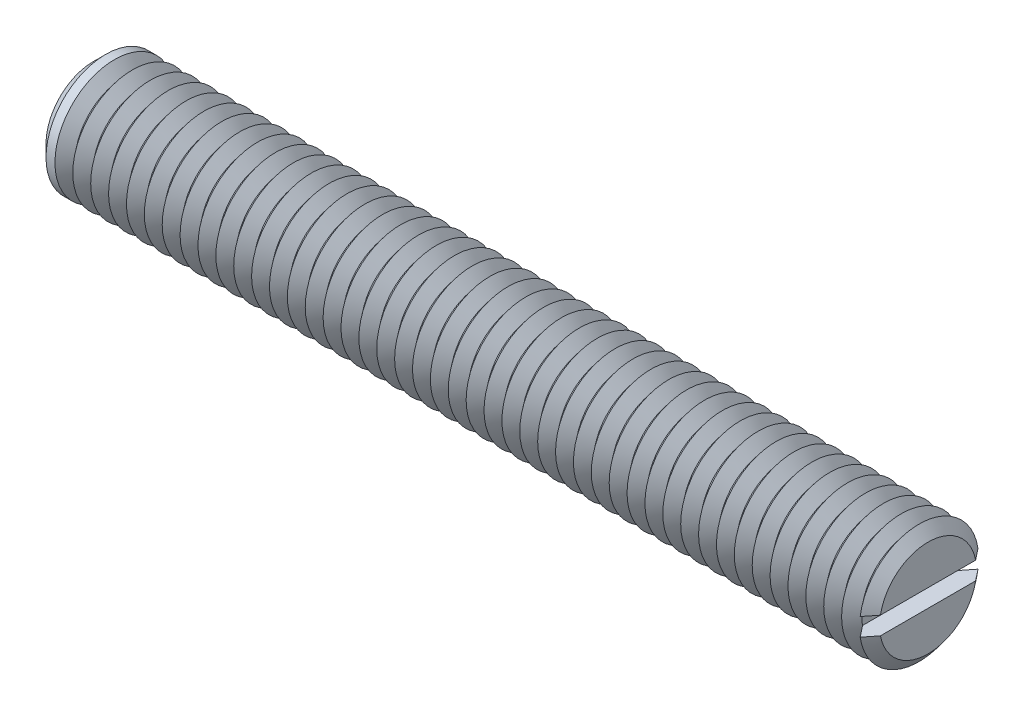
ISO-10303-21;
HEADER;
FILE_DESCRIPTION(('STEP AP214'),'2;1');
FILE_NAME('part.step','',(''),(''),'','','');
FILE_SCHEMA(('AUTOMOTIVE_DESIGN { 1 0 10303 214 1 1 1 1 }'));
ENDSEC;
DATA;
#1=APPLICATION_CONTEXT('core data for automotive mechanical design processes');
#2=APPLICATION_PROTOCOL_DEFINITION('international standard','automotive_design',2000,#1);
#3=PRODUCT_CONTEXT('',#1,'mechanical');
#4=PRODUCT('Part','Part','',(#3));
#5=PRODUCT_RELATED_PRODUCT_CATEGORY('part','',(#4));
#6=PRODUCT_DEFINITION_FORMATION('','',#4);
#7=PRODUCT_DEFINITION_CONTEXT('part definition',#1,'design');
#8=PRODUCT_DEFINITION('design','',#6,#7);
#9=PRODUCT_DEFINITION_SHAPE('','',#8);
#10=(LENGTH_UNIT() NAMED_UNIT(*) SI_UNIT(.MILLI.,.METRE.));
#11=(NAMED_UNIT(*) PLANE_ANGLE_UNIT() SI_UNIT($,.RADIAN.));
#12=(NAMED_UNIT(*) SI_UNIT($,.STERADIAN.) SOLID_ANGLE_UNIT());
#13=UNCERTAINTY_MEASURE_WITH_UNIT(LENGTH_MEASURE(1.E-05),#10,'distance_accuracy_value','');
#14=(GEOMETRIC_REPRESENTATION_CONTEXT(3) GLOBAL_UNCERTAINTY_ASSIGNED_CONTEXT((#13)) GLOBAL_UNIT_ASSIGNED_CONTEXT((#10,
#11,#12)) REPRESENTATION_CONTEXT('',''));
#15=CARTESIAN_POINT('',(0.,0.,0.));
#16=DIRECTION('',(0.,0.,1.));
#17=DIRECTION('',(1.,0.,0.));
#18=AXIS2_PLACEMENT_3D('',#15,#16,#17);
#19=CARTESIAN_POINT('',(34.25,0.,0.));
#20=DIRECTION('',(1.,0.,0.));
#21=DIRECTION('',(0.,0.,-1.));
#22=AXIS2_PLACEMENT_3D('',#19,#20,#21);
#23=CONICAL_SURFACE('',#22,5.,0.895664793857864);
#24=CARTESIAN_POINT('',(34.25,0.,0.));
#25=DIRECTION('',(-1.,0.,0.));
#26=DIRECTION('',(0.,0.,1.));
#27=AXIS2_PLACEMENT_3D('',#24,#25,#26);
#28=CIRCLE('',#27,5.);
#29=CARTESIAN_POINT('',(34.25,-0.75,-4.9434299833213));
#30=VERTEX_POINT('',#29);
#31=CARTESIAN_POINT('',(34.25,-0.75,4.9434299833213));
#32=VERTEX_POINT('',#31);
#33=EDGE_CURVE('E117',#30,#32,#28,.T.);
#34=ORIENTED_EDGE('',*,*,#33,.T.);
#35=CARTESIAN_POINT('',(38.9886555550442,-0.75,-10.8927895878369));
#36=CARTESIAN_POINT('',(38.678663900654,-0.75,-10.5046848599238));
#37=CARTESIAN_POINT('',(38.3687121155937,-0.75,-10.1165482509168));
#38=CARTESIAN_POINT('',(37.7489116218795,-0.75,-9.34012563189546));
#39=CARTESIAN_POINT('',(37.4390629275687,-0.75,-8.95183961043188));
#40=CARTESIAN_POINT('',(36.8189382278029,-0.75,-8.17433811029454));
#41=CARTESIAN_POINT('',(36.5086626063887,-0.75,-7.78512232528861));
#42=CARTESIAN_POINT('',(35.8884400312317,-0.75,-7.00649525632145));
#43=CARTESIAN_POINT('',(35.5784930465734,-0.75,-6.61708399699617));
#44=CARTESIAN_POINT('',(35.1053943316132,-0.75,-6.02191131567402));
#45=CARTESIAN_POINT('',(34.9420627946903,-0.75,-5.81629283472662));
#46=CARTESIAN_POINT('',(34.6155893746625,-0.75,-5.40490151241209));
#47=CARTESIAN_POINT('',(34.4524474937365,-0.75,-5.19912866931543));
#48=CARTESIAN_POINT('',(34.1263799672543,-0.75,-4.78730226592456));
#49=CARTESIAN_POINT('',(33.9634544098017,-0.75,-4.58124863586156));
#50=CARTESIAN_POINT('',(33.638006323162,-0.75,-4.16883695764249));
#51=CARTESIAN_POINT('',(33.4754837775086,-0.75,-3.96247892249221));
#52=CARTESIAN_POINT('',(33.1512888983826,-0.75,-3.54956515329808));
#53=CARTESIAN_POINT('',(32.9896156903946,-0.75,-3.3430101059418));
#54=CARTESIAN_POINT('',(32.6672688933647,-0.75,-2.92906737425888));
#55=CARTESIAN_POINT('',(32.5065954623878,-0.75,-2.72167956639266));
#56=CARTESIAN_POINT('',(32.2671162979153,-0.75,-2.40952296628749));
#57=CARTESIAN_POINT('',(32.187569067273,-0.75,-2.30532351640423));
#58=CARTESIAN_POINT('',(32.0292089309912,-0.75,-2.0963686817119));
#59=CARTESIAN_POINT('',(31.9503960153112,-0.75,-1.99161330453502));
#60=CARTESIAN_POINT('',(31.7939159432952,-0.75,-1.78128982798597));
#61=CARTESIAN_POINT('',(31.7162485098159,-0.75,-1.67572193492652));
#62=CARTESIAN_POINT('',(31.5627483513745,-0.75,-1.46326300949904));
#63=CARTESIAN_POINT('',(31.4869154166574,-0.75,-1.35637213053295));
#64=CARTESIAN_POINT('',(31.3961291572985,-0.75,-1.22407390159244));
#65=CARTESIAN_POINT('',(31.3795740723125,-0.75,-1.19976686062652));
#66=CARTESIAN_POINT('',(31.3466682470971,-0.75,-1.15101442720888));
#67=CARTESIAN_POINT('',(31.3303175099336,-0.75,-1.12656903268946));
#68=CARTESIAN_POINT('',(31.2816161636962,-0.75,-1.05299302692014));
#69=CARTESIAN_POINT('',(31.2496192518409,-0.75,-1.00362669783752));
#70=CARTESIAN_POINT('',(31.1868890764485,-0.75,-0.903957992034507));
#71=CARTESIAN_POINT('',(31.1561584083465,-0.75,-0.853653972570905));
#72=CARTESIAN_POINT('',(31.0966309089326,-0.75,-0.751913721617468));
#73=CARTESIAN_POINT('',(31.0678337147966,-0.75,-0.700477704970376));
#74=CARTESIAN_POINT('',(31.0225435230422,-0.75,-0.613963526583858));
#75=CARTESIAN_POINT('',(31.0052186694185,-0.75,-0.579327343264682));
#76=CARTESIAN_POINT('',(30.9722687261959,-0.75,-0.509265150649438));
#77=CARTESIAN_POINT('',(30.9566439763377,-0.75,-0.473838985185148));
#78=CARTESIAN_POINT('',(30.9132659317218,-0.75,-0.366382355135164));
#79=CARTESIAN_POINT('',(30.8888237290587,-0.75,-0.29284290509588));
#80=CARTESIAN_POINT('',(30.8658405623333,-0.75,-0.189809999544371));
#81=CARTESIAN_POINT('',(30.8606856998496,-0.75,-0.161782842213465));
#82=CARTESIAN_POINT('',(30.8527704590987,-0.75,-0.105398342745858));
#83=CARTESIAN_POINT('',(30.8500088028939,-0.75,-0.0770411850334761));
#84=CARTESIAN_POINT('',(30.8470684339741,-0.75,-0.0202548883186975));
#85=CARTESIAN_POINT('',(30.8468839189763,-0.75,0.00817394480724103));
#86=CARTESIAN_POINT('',(30.8490950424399,-0.75,0.0649322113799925));
#87=CARTESIAN_POINT('',(30.851491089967,-0.75,0.0932616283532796));
#88=CARTESIAN_POINT('',(30.8596937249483,-0.75,0.157351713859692));
#89=CARTESIAN_POINT('',(30.8662565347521,-0.75,0.19301541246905));
#90=CARTESIAN_POINT('',(30.8827020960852,-0.75,0.263573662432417));
#91=CARTESIAN_POINT('',(30.8925874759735,-0.75,0.298467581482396));
#92=CARTESIAN_POINT('',(30.9150598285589,-0.75,0.367652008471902));
#93=CARTESIAN_POINT('',(30.9276667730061,-0.75,0.401935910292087));
#94=CARTESIAN_POINT('',(30.9549130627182,-0.75,0.469664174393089));
#95=CARTESIAN_POINT('',(30.9695519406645,-0.75,0.503108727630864));
#96=CARTESIAN_POINT('',(31.0166350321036,-0.75,0.604259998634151));
#97=CARTESIAN_POINT('',(31.051542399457,-0.75,0.670810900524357));
#98=CARTESIAN_POINT('',(31.1250588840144,-0.75,0.801849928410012));
#99=CARTESIAN_POINT('',(31.1636717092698,-0.75,0.866335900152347));
#100=CARTESIAN_POINT('',(31.2432739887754,-0.75,0.9940503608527));
#101=CARTESIAN_POINT('',(31.284269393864,-0.75,1.05727512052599));
#102=CARTESIAN_POINT('',(31.3677403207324,-0.75,1.18274150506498));
#103=CARTESIAN_POINT('',(31.4102160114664,-0.75,1.24498301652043));
#104=CARTESIAN_POINT('',(31.4963066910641,-0.75,1.36895722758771));
#105=CARTESIAN_POINT('',(31.5399248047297,-0.75,1.43068775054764));
#106=CARTESIAN_POINT('',(31.6278819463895,-0.75,1.55364126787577));
#107=CARTESIAN_POINT('',(31.672221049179,-0.75,1.61486420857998));
#108=CARTESIAN_POINT('',(31.7613408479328,-0.75,1.73681254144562));
#109=CARTESIAN_POINT('',(31.8061205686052,-0.75,1.79753864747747));
#110=CARTESIAN_POINT('',(31.8960732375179,-0.75,1.91869503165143));
#111=CARTESIAN_POINT('',(31.9412461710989,-0.75,1.97912532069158));
#112=CARTESIAN_POINT('',(32.076109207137,-0.75,2.1586036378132));
#113=CARTESIAN_POINT('',(32.1662359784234,-0.75,2.27732336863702));
#114=CARTESIAN_POINT('',(32.3472315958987,-0.75,2.51419617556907));
#115=CARTESIAN_POINT('',(32.4381004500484,-0.75,2.63234924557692));
#116=CARTESIAN_POINT('',(32.7114512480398,-0.75,2.98624879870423));
#117=CARTESIAN_POINT('',(32.8946699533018,-0.75,3.22142577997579));
#118=CARTESIAN_POINT('',(33.262238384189,-0.75,3.69117947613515));
#119=CARTESIAN_POINT('',(33.4465888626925,-0.75,3.92575559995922));
#120=CARTESIAN_POINT('',(33.81587911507,-0.75,4.39443534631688));
#121=CARTESIAN_POINT('',(34.000818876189,-0.75,4.6285389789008));
#122=CARTESIAN_POINT('',(34.3703317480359,-0.75,5.09551589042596));
#123=CARTESIAN_POINT('',(34.5549033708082,-0.75,5.32839034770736));
#124=CARTESIAN_POINT('',(34.9242990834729,-0.75,5.7939410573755));
#125=CARTESIAN_POINT('',(35.1091231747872,-0.75,6.02661730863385));
#126=CARTESIAN_POINT('',(35.6637745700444,-0.75,6.72433690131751));
#127=CARTESIAN_POINT('',(36.0338620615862,-0.75,7.18917337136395));
#128=CARTESIAN_POINT('',(36.6190458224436,-0.75,7.9235623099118));
#129=CARTESIAN_POINT('',(36.8340169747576,-0.75,8.19321453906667));
#130=CARTESIAN_POINT('',(37.2640698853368,-0.75,8.73245662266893));
#131=CARTESIAN_POINT('',(37.4791516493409,-0.75,9.00204647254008));
#132=CARTESIAN_POINT('',(37.9099436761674,-0.75,9.54186292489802));
#133=CARTESIAN_POINT('',(38.1256541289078,-0.75,9.81208937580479));
#134=CARTESIAN_POINT('',(38.5571210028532,-0.75,10.3524795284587));
#135=CARTESIAN_POINT('',(38.7728774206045,-0.75,10.6226432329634));
#136=CARTESIAN_POINT('',(38.9886555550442,-0.75,10.8927895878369));
#137=B_SPLINE_CURVE_WITH_KNOTS('',3,(#35,#36,#37,#38,#39,#40,#41,#42,#43,#44,#45,#46,#47,#48,
#49,#50,#51,#52,#53,#54,#55,#56,#57,#58,#59,#60,#61,#62,#63,#64,#65,#66,#67,#68,#69,#70,#71,#72,
#73,#74,#75,#76,#77,#78,#79,#80,#81,#82,#83,#84,#85,#86,#87,#88,#89,#90,#91,#92,#93,#94,#95,#96,
#97,#98,#99,#100,#101,#102,#103,#104,#105,#106,#107,#108,#109,#110,#111,#112,#113,#114,#115,
#116,#117,#118,#119,#120,#121,#122,#123,#124,#125,#126,#127,#128,#129,#130,#131,#132,#133,#134,
#135,#136),.UNSPECIFIED.,.F.,.F.,(4,2,2,2,2,2,2,2,2,2,2,2,2,2,2,2,2,2,2,2,2,2,2,2,2,2,2,2,2,2,2,
2,2,2,2,2,2,2,2,2,2,2,2,2,2,2,2,2,2,2,4),(0.,1.49012787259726,2.98041311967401,4.47367759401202,
5.96678625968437,6.75457128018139,7.5423652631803,8.33041673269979,9.11843545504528,
9.90534542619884,10.6923767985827,11.0856530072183,11.4789238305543,11.8720978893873,
12.265226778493,12.3534535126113,12.441681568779,12.6181526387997,12.7949690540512,
12.9717521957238,13.0878863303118,13.2040436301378,13.43522465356,13.5206311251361,
13.605991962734,13.6911605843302,13.7763427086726,13.8849305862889,13.9936045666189,
14.1031049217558,14.2125801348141,14.4377857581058,14.6632191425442,14.8892420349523,
15.1152908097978,15.3420406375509,15.5688141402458,15.795165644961,16.0215087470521,
16.4686664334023,16.91582892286,17.8101909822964,18.7052318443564,19.6002534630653,
20.4916985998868,21.3831487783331,23.1656575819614,24.2002223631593,25.2348477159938,
26.2721422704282,27.3093757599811),.UNSPECIFIED.);
#138=CARTESIAN_POINT('',(33.5,-0.75,3.99343248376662));
#139=VERTEX_POINT('',#138);
#140=EDGE_CURVE('E109',#139,#32,#137,.T.);
#141=ORIENTED_EDGE('',*,*,#140,.F.);
#142=CARTESIAN_POINT('',(33.5,0.,0.));
#143=DIRECTION('',(-1.,0.,0.));
#144=DIRECTION('',(0.,0.,1.));
#145=AXIS2_PLACEMENT_3D('',#142,#143,#144);
#146=CIRCLE('',#145,4.06325030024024);
#147=CARTESIAN_POINT('',(33.5,-0.75,-3.99343248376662));
#148=VERTEX_POINT('',#147);
#149=EDGE_CURVE('E585',#148,#139,#146,.T.);
#150=ORIENTED_EDGE('',*,*,#149,.F.);
#151=EDGE_CURVE('E58',#30,#148,#137,.T.);
#152=ORIENTED_EDGE('',*,*,#151,.F.);
#153=EDGE_LOOP('',(#34,#141,#150,#152));
#154=FACE_BOUND('',#153,.T.);
#155=ADVANCED_FACE('F37',(#154),#23,.T.);
#156=CARTESIAN_POINT('',(34.25,0.75,4.9434299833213));
#157=VERTEX_POINT('',#156);
#158=CARTESIAN_POINT('',(34.25,0.75,-4.9434299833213));
#159=VERTEX_POINT('',#158);
#160=EDGE_CURVE('E100',#157,#159,#28,.T.);
#161=ORIENTED_EDGE('',*,*,#160,.T.);
#162=CARTESIAN_POINT('',(38.9886555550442,0.75,10.8927895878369));
#163=CARTESIAN_POINT('',(38.678663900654,0.75,10.5046848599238));
#164=CARTESIAN_POINT('',(38.3687121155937,0.75,10.1165482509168));
#165=CARTESIAN_POINT('',(37.7489116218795,0.75,9.34012563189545));
#166=CARTESIAN_POINT('',(37.4390629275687,0.75,8.95183961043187));
#167=CARTESIAN_POINT('',(36.8189382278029,0.75,8.17433811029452));
#168=CARTESIAN_POINT('',(36.5086626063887,0.75,7.78512232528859));
#169=CARTESIAN_POINT('',(35.8884400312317,0.75,7.00649525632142));
#170=CARTESIAN_POINT('',(35.5784930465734,0.75,6.61708399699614));
#171=CARTESIAN_POINT('',(35.1053943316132,0.75,6.02191131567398));
#172=CARTESIAN_POINT('',(34.9420627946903,0.75,5.81629283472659));
#173=CARTESIAN_POINT('',(34.6155893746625,0.75,5.40490151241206));
#174=CARTESIAN_POINT('',(34.4524474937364,0.75,5.1991286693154));
#175=CARTESIAN_POINT('',(34.1263799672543,0.75,4.78730226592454));
#176=CARTESIAN_POINT('',(33.9634544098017,0.75,4.58124863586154));
#177=CARTESIAN_POINT('',(33.638006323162,0.75,4.16883695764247));
#178=CARTESIAN_POINT('',(33.4754837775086,0.75,3.96247892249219));
#179=CARTESIAN_POINT('',(33.1512888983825,0.75,3.54956515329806));
#180=CARTESIAN_POINT('',(32.9896156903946,0.75,3.34301010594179));
#181=CARTESIAN_POINT('',(32.6672688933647,0.75,2.92906737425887));
#182=CARTESIAN_POINT('',(32.5065954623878,0.75,2.72167956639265));
#183=CARTESIAN_POINT('',(32.2671162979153,0.75,2.40952296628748));
#184=CARTESIAN_POINT('',(32.187569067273,0.75,2.30532351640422));
#185=CARTESIAN_POINT('',(32.0292089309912,0.75,2.09636868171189));
#186=CARTESIAN_POINT('',(31.9503960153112,0.75,1.99161330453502));
#187=CARTESIAN_POINT('',(31.7939159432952,0.75,1.78128982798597));
#188=CARTESIAN_POINT('',(31.7162485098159,0.75,1.67572193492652));
#189=CARTESIAN_POINT('',(31.5627483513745,0.75,1.46326300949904));
#190=CARTESIAN_POINT('',(31.4869154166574,0.75,1.35637213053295));
#191=CARTESIAN_POINT('',(31.3961291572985,0.75,1.22407390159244));
#192=CARTESIAN_POINT('',(31.3795740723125,0.75,1.19976686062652));
#193=CARTESIAN_POINT('',(31.3466682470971,0.75,1.15101442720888));
#194=CARTESIAN_POINT('',(31.3303175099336,0.75,1.12656903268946));
#195=CARTESIAN_POINT('',(31.2816161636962,0.75,1.05299302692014));
#196=CARTESIAN_POINT('',(31.2496192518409,0.75,1.00362669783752));
#197=CARTESIAN_POINT('',(31.1868890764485,0.75,0.903957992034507));
#198=CARTESIAN_POINT('',(31.1561584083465,0.75,0.853653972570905));
#199=CARTESIAN_POINT('',(31.0966309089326,0.75,0.751913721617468));
#200=CARTESIAN_POINT('',(31.0678337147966,0.75,0.700477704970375));
#201=CARTESIAN_POINT('',(31.0225435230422,0.75,0.613963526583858));
#202=CARTESIAN_POINT('',(31.0052186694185,0.75,0.579327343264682));
#203=CARTESIAN_POINT('',(30.9722687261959,0.75,0.509265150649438));
#204=CARTESIAN_POINT('',(30.9566439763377,0.75,0.473838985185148));
#205=CARTESIAN_POINT('',(30.9132659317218,0.75,0.366382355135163));
#206=CARTESIAN_POINT('',(30.8888237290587,0.75,0.29284290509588));
#207=CARTESIAN_POINT('',(30.8658405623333,0.75,0.189809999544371));
#208=CARTESIAN_POINT('',(30.8606856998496,0.75,0.161782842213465));
#209=CARTESIAN_POINT('',(30.8527704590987,0.75,0.105398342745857));
#210=CARTESIAN_POINT('',(30.8500088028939,0.75,0.0770411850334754));
#211=CARTESIAN_POINT('',(30.8470684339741,0.75,0.0202548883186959));
#212=CARTESIAN_POINT('',(30.8468839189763,0.75,-0.00817394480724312));
#213=CARTESIAN_POINT('',(30.8490950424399,0.75,-0.0649322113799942));
#214=CARTESIAN_POINT('',(30.851491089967,0.75,-0.0932616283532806));
#215=CARTESIAN_POINT('',(30.8596937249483,0.75,-0.157351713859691));
#216=CARTESIAN_POINT('',(30.8662565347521,0.75,-0.19301541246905));
#217=CARTESIAN_POINT('',(30.8827020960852,0.75,-0.263573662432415));
#218=CARTESIAN_POINT('',(30.8925874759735,0.75,-0.298467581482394));
#219=CARTESIAN_POINT('',(30.9150598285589,0.75,-0.3676520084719));
#220=CARTESIAN_POINT('',(30.9276667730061,0.75,-0.401935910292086));
#221=CARTESIAN_POINT('',(30.9549130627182,0.75,-0.469664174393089));
#222=CARTESIAN_POINT('',(30.9695519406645,0.75,-0.503108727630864));
#223=CARTESIAN_POINT('',(31.0166350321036,0.75,-0.604259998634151));
#224=CARTESIAN_POINT('',(31.051542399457,0.75,-0.670810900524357));
#225=CARTESIAN_POINT('',(31.1250588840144,0.75,-0.801849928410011));
#226=CARTESIAN_POINT('',(31.1636717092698,0.75,-0.866335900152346));
#227=CARTESIAN_POINT('',(31.2432739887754,0.75,-0.9940503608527));
#228=CARTESIAN_POINT('',(31.284269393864,0.75,-1.05727512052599));
#229=CARTESIAN_POINT('',(31.3677403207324,0.75,-1.18274150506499));
#230=CARTESIAN_POINT('',(31.4102160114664,0.75,-1.24498301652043));
#231=CARTESIAN_POINT('',(31.4963066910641,0.75,-1.36895722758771));
#232=CARTESIAN_POINT('',(31.5399248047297,0.75,-1.43068775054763));
#233=CARTESIAN_POINT('',(31.6278819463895,0.75,-1.55364126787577));
#234=CARTESIAN_POINT('',(31.672221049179,0.75,-1.61486420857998));
#235=CARTESIAN_POINT('',(31.7613408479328,0.75,-1.73681254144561));
#236=CARTESIAN_POINT('',(31.8061205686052,0.75,-1.79753864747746));
#237=CARTESIAN_POINT('',(31.8960732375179,0.75,-1.91869503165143));
#238=CARTESIAN_POINT('',(31.9412461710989,0.75,-1.97912532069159));
#239=CARTESIAN_POINT('',(32.076109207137,0.75,-2.15860363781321));
#240=CARTESIAN_POINT('',(32.1662359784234,0.75,-2.27732336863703));
#241=CARTESIAN_POINT('',(32.3472315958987,0.75,-2.51419617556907));
#242=CARTESIAN_POINT('',(32.4381004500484,0.75,-2.63234924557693));
#243=CARTESIAN_POINT('',(32.7114512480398,0.75,-2.98624879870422));
#244=CARTESIAN_POINT('',(32.8946699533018,0.75,-3.22142577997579));
#245=CARTESIAN_POINT('',(33.262238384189,0.75,-3.69117947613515));
#246=CARTESIAN_POINT('',(33.4465888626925,0.75,-3.92575559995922));
#247=CARTESIAN_POINT('',(33.81587911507,0.75,-4.39443534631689));
#248=CARTESIAN_POINT('',(34.000818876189,0.75,-4.6285389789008));
#249=CARTESIAN_POINT('',(34.370331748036,0.75,-5.09551589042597));
#250=CARTESIAN_POINT('',(34.5549033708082,0.75,-5.32839034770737));
#251=CARTESIAN_POINT('',(34.9242990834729,0.75,-5.79394105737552));
#252=CARTESIAN_POINT('',(35.1091231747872,0.75,-6.02661730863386));
#253=CARTESIAN_POINT('',(35.6637745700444,0.75,-6.72433690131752));
#254=CARTESIAN_POINT('',(36.0338620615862,0.75,-7.18917337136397));
#255=CARTESIAN_POINT('',(36.6190458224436,0.75,-7.92356230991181));
#256=CARTESIAN_POINT('',(36.8340169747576,0.75,-8.19321453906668));
#257=CARTESIAN_POINT('',(37.2640698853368,0.75,-8.73245662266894));
#258=CARTESIAN_POINT('',(37.479151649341,0.75,-9.00204647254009));
#259=CARTESIAN_POINT('',(37.9099436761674,0.75,-9.54186292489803));
#260=CARTESIAN_POINT('',(38.1256541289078,0.75,-9.81208937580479));
#261=CARTESIAN_POINT('',(38.5571210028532,0.75,-10.3524795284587));
#262=CARTESIAN_POINT('',(38.7728774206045,0.75,-10.6226432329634));
#263=CARTESIAN_POINT('',(38.9886555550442,0.75,-10.8927895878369));
#264=B_SPLINE_CURVE_WITH_KNOTS('',3,(#162,#163,#164,#165,#166,#167,#168,#169,#170,#171,#172,
#173,#174,#175,#176,#177,#178,#179,#180,#181,#182,#183,#184,#185,#186,#187,#188,#189,#190,#191,
#192,#193,#194,#195,#196,#197,#198,#199,#200,#201,#202,#203,#204,#205,#206,#207,#208,#209,#210,
#211,#212,#213,#214,#215,#216,#217,#218,#219,#220,#221,#222,#223,#224,#225,#226,#227,#228,#229,
#230,#231,#232,#233,#234,#235,#236,#237,#238,#239,#240,#241,#242,#243,#244,#245,#246,#247,#248,
#249,#250,#251,#252,#253,#254,#255,#256,#257,#258,#259,#260,#261,#262,#263),.UNSPECIFIED.,.F.,
.F.,(4,2,2,2,2,2,2,2,2,2,2,2,2,2,2,2,2,2,2,2,2,2,2,2,2,2,2,2,2,2,2,2,2,2,2,2,2,2,2,2,2,2,2,2,2,
2,2,2,2,2,4),(0.,1.49012787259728,2.98041311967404,4.47367759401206,5.96678625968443,
6.75457128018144,7.54236526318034,8.33041673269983,9.11843545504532,9.90534542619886,
10.6923767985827,11.0856530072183,11.4789238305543,11.8720978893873,12.265226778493,
12.3534535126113,12.441681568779,12.6181526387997,12.7949690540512,12.9717521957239,
13.0878863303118,13.2040436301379,13.43522465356,13.5206311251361,13.6059919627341,
13.6911605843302,13.7763427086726,13.8849305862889,13.9936045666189,14.1031049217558,
14.2125801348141,14.4377857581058,14.6632191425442,14.8892420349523,15.1152908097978,
15.3420406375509,15.5688141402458,15.795165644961,16.0215087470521,16.4686664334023,
16.91582892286,17.8101909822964,18.7052318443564,19.6002534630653,20.4916985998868,
21.3831487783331,23.1656575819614,24.2002223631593,25.2348477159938,26.2721422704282,
27.3093757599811),.UNSPECIFIED.);
#265=CARTESIAN_POINT('',(33.5,0.75,-3.99343248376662));
#266=VERTEX_POINT('',#265);
#267=EDGE_CURVE('E110',#266,#159,#264,.T.);
#268=ORIENTED_EDGE('',*,*,#267,.F.);
#269=CARTESIAN_POINT('',(33.5,0.75,3.99343248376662));
#270=VERTEX_POINT('',#269);
#271=EDGE_CURVE('E103',#270,#266,#146,.T.);
#272=ORIENTED_EDGE('',*,*,#271,.F.);
#273=EDGE_CURVE('E97',#157,#270,#264,.T.);
#274=ORIENTED_EDGE('',*,*,#273,.F.);
#275=EDGE_LOOP('',(#161,#268,#272,#274));
#276=FACE_BOUND('',#275,.T.);
#277=ADVANCED_FACE('F99',(#276),#23,.T.);
#278=CARTESIAN_POINT('',(33.5,0.,0.));
#279=DIRECTION('',(-1.,0.,0.));
#280=DIRECTION('',(0.,0.,1.));
#281=AXIS2_PLACEMENT_3D('',#278,#279,#280);
#282=CONICAL_SURFACE('',#281,4.06325030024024,0.895664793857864);
#283=CARTESIAN_POINT('',(32.75,0.,0.));
#284=DIRECTION('',(-1.,0.,0.));
#285=DIRECTION('',(0.,0.,1.));
#286=AXIS2_PLACEMENT_3D('',#283,#284,#285);
#287=CIRCLE('',#286,5.);
#288=CARTESIAN_POINT('',(32.75,0.,5.));
#289=VERTEX_POINT('',#288);
#290=EDGE_CURVE('E572',#289,#289,#287,.T.);
#291=ORIENTED_EDGE('',*,*,#290,.F.);
#292=EDGE_LOOP('',(#291));
#293=FACE_BOUND('',#292,.T.);
#294=ORIENTED_EDGE('',*,*,#271,.T.);
#295=EDGE_CURVE('E579',#266,#148,#146,.T.);
#296=ORIENTED_EDGE('',*,*,#295,.T.);
#297=ORIENTED_EDGE('',*,*,#149,.T.);
#298=EDGE_CURVE('E578',#139,#270,#146,.T.);
#299=ORIENTED_EDGE('',*,*,#298,.T.);
#300=EDGE_LOOP('',(#294,#296,#297,#299));
#301=FACE_BOUND('',#300,.T.);
#302=ADVANCED_FACE('F168',(#293,#301),#282,.T.);
#303=CARTESIAN_POINT('',(35.,0.,0.));
#304=DIRECTION('',(1.,0.,0.));
#305=DIRECTION('',(0.,0.,-1.));
#306=AXIS2_PLACEMENT_3D('',#303,#304,#305);
#307=PLANE('',#306);
#308=CARTESIAN_POINT('',(35.,0.,0.));
#309=DIRECTION('',(-1.,0.,0.));
#310=DIRECTION('',(0.,0.,1.));
#311=AXIS2_PLACEMENT_3D('',#308,#309,#310);
#312=CIRCLE('',#311,4.06325030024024);
#313=CARTESIAN_POINT('',(35.,0.75,3.99343248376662));
#314=VERTEX_POINT('',#313);
#315=CARTESIAN_POINT('',(35.,0.75,-3.99343248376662));
#316=VERTEX_POINT('',#315);
#317=EDGE_CURVE('E160',#314,#316,#312,.T.);
#318=ORIENTED_EDGE('',*,*,#317,.F.);
#319=DIRECTION('',(0.,0.,1.));
#320=VECTOR('',#319,1.);
#321=CARTESIAN_POINT('',(35.,0.75,0.));
#322=LINE('',#321,#320);
#323=EDGE_CURVE('E122',#316,#314,#322,.T.);
#324=ORIENTED_EDGE('',*,*,#323,.F.);
#325=EDGE_LOOP('',(#318,#324));
#326=FACE_BOUND('',#325,.T.);
#327=ADVANCED_FACE('F172',(#326),#307,.T.);
#328=CARTESIAN_POINT('',(35.,-0.75,-3.99343248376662));
#329=VERTEX_POINT('',#328);
#330=CARTESIAN_POINT('',(35.,-0.75,3.99343248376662));
#331=VERTEX_POINT('',#330);
#332=EDGE_CURVE('E66',#329,#331,#312,.T.);
#333=ORIENTED_EDGE('',*,*,#332,.F.);
#334=DIRECTION('',(0.,0.,-1.));
#335=VECTOR('',#334,1.);
#336=CARTESIAN_POINT('',(35.,-0.75,0.));
#337=LINE('',#336,#335);
#338=EDGE_CURVE('E136',#331,#329,#337,.T.);
#339=ORIENTED_EDGE('',*,*,#338,.F.);
#340=EDGE_LOOP('',(#333,#339));
#341=FACE_BOUND('',#340,.T.);
#342=ADVANCED_FACE('F201',(#341),#307,.T.);
#343=CARTESIAN_POINT('',(35.,0.,0.));
#344=DIRECTION('',(-1.,0.,0.));
#345=DIRECTION('',(0.,0.,1.));
#346=AXIS2_PLACEMENT_3D('',#343,#344,#345);
#347=CONICAL_SURFACE('',#346,4.06325030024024,0.895664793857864);
#348=ORIENTED_EDGE('',*,*,#160,.F.);
#349=CARTESIAN_POINT('',(29.5113444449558,0.75,-10.8927895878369));
#350=CARTESIAN_POINT('',(29.821336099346,0.75,-10.5046848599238));
#351=CARTESIAN_POINT('',(30.1312878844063,0.75,-10.1165482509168));
#352=CARTESIAN_POINT('',(30.7510883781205,0.75,-9.34012563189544));
#353=CARTESIAN_POINT('',(31.0609370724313,0.75,-8.95183961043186));
#354=CARTESIAN_POINT('',(31.6810617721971,0.75,-8.17433811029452));
#355=CARTESIAN_POINT('',(31.9913373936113,0.75,-7.78512232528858));
#356=CARTESIAN_POINT('',(32.6115599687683,0.75,-7.00649525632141));
#357=CARTESIAN_POINT('',(32.9215069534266,0.75,-6.61708399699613));
#358=CARTESIAN_POINT('',(33.3946056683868,0.75,-6.02191131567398));
#359=CARTESIAN_POINT('',(33.5579372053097,0.75,-5.81629283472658));
#360=CARTESIAN_POINT('',(33.8844106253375,0.75,-5.40490151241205));
#361=CARTESIAN_POINT('',(34.0475525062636,0.75,-5.1991286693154));
#362=CARTESIAN_POINT('',(34.3736200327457,0.75,-4.78730226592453));
#363=CARTESIAN_POINT('',(34.5365455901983,0.75,-4.58124863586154));
#364=CARTESIAN_POINT('',(34.861993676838,0.75,-4.16883695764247));
#365=CARTESIAN_POINT('',(35.0245162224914,0.75,-3.96247892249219));
#366=CARTESIAN_POINT('',(35.3487111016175,0.75,-3.54956515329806));
#367=CARTESIAN_POINT('',(35.5103843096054,0.75,-3.34301010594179));
#368=CARTESIAN_POINT('',(35.8327311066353,0.75,-2.92906737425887));
#369=CARTESIAN_POINT('',(35.9934045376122,0.75,-2.72167956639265));
#370=CARTESIAN_POINT('',(36.2328837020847,0.75,-2.40952296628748));
#371=CARTESIAN_POINT('',(36.312430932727,0.75,-2.30532351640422));
#372=CARTESIAN_POINT('',(36.4707910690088,0.75,-2.09636868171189));
#373=CARTESIAN_POINT('',(36.5496039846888,0.75,-1.99161330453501));
#374=CARTESIAN_POINT('',(36.7060840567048,0.75,-1.78128982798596));
#375=CARTESIAN_POINT('',(36.7837514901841,0.75,-1.67572193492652));
#376=CARTESIAN_POINT('',(36.9372516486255,0.75,-1.46326300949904));
#377=CARTESIAN_POINT('',(37.0130845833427,0.75,-1.35637213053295));
#378=CARTESIAN_POINT('',(37.1038708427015,0.75,-1.22407390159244));
#379=CARTESIAN_POINT('',(37.1204259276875,0.75,-1.19976686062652));
#380=CARTESIAN_POINT('',(37.1533317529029,0.75,-1.15101442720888));
#381=CARTESIAN_POINT('',(37.1696824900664,0.75,-1.12656903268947));
#382=CARTESIAN_POINT('',(37.2183838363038,0.75,-1.05299302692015));
#383=CARTESIAN_POINT('',(37.2503807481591,0.75,-1.00362669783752));
#384=CARTESIAN_POINT('',(37.3131109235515,0.75,-0.903957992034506));
#385=CARTESIAN_POINT('',(37.3438415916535,0.75,-0.853653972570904));
#386=CARTESIAN_POINT('',(37.4033690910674,0.75,-0.751913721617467));
#387=CARTESIAN_POINT('',(37.4321662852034,0.75,-0.700477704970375));
#388=CARTESIAN_POINT('',(37.4774564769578,0.75,-0.613963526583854));
#389=CARTESIAN_POINT('',(37.4947813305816,0.75,-0.579327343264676));
#390=CARTESIAN_POINT('',(37.5277312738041,0.75,-0.509265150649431));
#391=CARTESIAN_POINT('',(37.5433560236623,0.75,-0.473838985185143));
#392=CARTESIAN_POINT('',(37.5867340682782,0.75,-0.366382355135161));
#393=CARTESIAN_POINT('',(37.6111762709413,0.75,-0.292842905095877));
#394=CARTESIAN_POINT('',(37.6341594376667,0.75,-0.189809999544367));
#395=CARTESIAN_POINT('',(37.6393143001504,0.75,-0.161782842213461));
#396=CARTESIAN_POINT('',(37.6472295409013,0.75,-0.105398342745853));
#397=CARTESIAN_POINT('',(37.6499911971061,0.75,-0.0770411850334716));
#398=CARTESIAN_POINT('',(37.6529315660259,0.75,-0.0202548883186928));
#399=CARTESIAN_POINT('',(37.6531160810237,0.75,0.00817394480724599));
#400=CARTESIAN_POINT('',(37.6509049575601,0.75,0.0649322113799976));
#401=CARTESIAN_POINT('',(37.648508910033,0.75,0.0932616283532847));
#402=CARTESIAN_POINT('',(37.6403062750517,0.75,0.157351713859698));
#403=CARTESIAN_POINT('',(37.6337434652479,0.75,0.193015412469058));
#404=CARTESIAN_POINT('',(37.6172979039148,0.75,0.263573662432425));
#405=CARTESIAN_POINT('',(37.6074125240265,0.75,0.298467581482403));
#406=CARTESIAN_POINT('',(37.5849401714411,0.75,0.367652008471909));
#407=CARTESIAN_POINT('',(37.5723332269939,0.75,0.401935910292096));
#408=CARTESIAN_POINT('',(37.5450869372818,0.75,0.469664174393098));
#409=CARTESIAN_POINT('',(37.5304480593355,0.75,0.503108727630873));
#410=CARTESIAN_POINT('',(37.4833649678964,0.75,0.604259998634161));
#411=CARTESIAN_POINT('',(37.448457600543,0.75,0.670810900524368));
#412=CARTESIAN_POINT('',(37.3749411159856,0.75,0.801849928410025));
#413=CARTESIAN_POINT('',(37.3363282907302,0.75,0.866335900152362));
#414=CARTESIAN_POINT('',(37.2567260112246,0.75,0.994050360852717));
#415=CARTESIAN_POINT('',(37.215730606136,0.75,1.05727512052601));
#416=CARTESIAN_POINT('',(37.1322596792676,0.75,1.182741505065));
#417=CARTESIAN_POINT('',(37.0897839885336,0.75,1.24498301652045));
#418=CARTESIAN_POINT('',(37.0036933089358,0.75,1.36895722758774));
#419=CARTESIAN_POINT('',(36.9600751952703,0.75,1.43068775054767));
#420=CARTESIAN_POINT('',(36.8721180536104,0.75,1.5536412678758));
#421=CARTESIAN_POINT('',(36.827778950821,0.75,1.61486420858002));
#422=CARTESIAN_POINT('',(36.7386591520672,0.75,1.73681254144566));
#423=CARTESIAN_POINT('',(36.6938794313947,0.75,1.79753864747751));
#424=CARTESIAN_POINT('',(36.6039267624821,0.75,1.91869503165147));
#425=CARTESIAN_POINT('',(36.558753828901,0.75,1.97912532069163));
#426=CARTESIAN_POINT('',(36.4238907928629,0.75,2.15860363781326));
#427=CARTESIAN_POINT('',(36.3337640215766,0.75,2.27732336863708));
#428=CARTESIAN_POINT('',(36.1527684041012,0.75,2.51419617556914));
#429=CARTESIAN_POINT('',(36.0618995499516,0.75,2.632349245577));
#430=CARTESIAN_POINT('',(35.7885487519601,0.75,2.98624879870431));
#431=CARTESIAN_POINT('',(35.6053300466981,0.75,3.22142577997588));
#432=CARTESIAN_POINT('',(35.237761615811,0.75,3.69117947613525));
#433=CARTESIAN_POINT('',(35.0534111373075,0.75,3.92575559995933));
#434=CARTESIAN_POINT('',(34.6841208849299,0.75,4.394435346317));
#435=CARTESIAN_POINT('',(34.4991811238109,0.75,4.62853897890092));
#436=CARTESIAN_POINT('',(34.1296682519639,0.75,5.0955158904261));
#437=CARTESIAN_POINT('',(33.9450966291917,0.75,5.32839034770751));
#438=CARTESIAN_POINT('',(33.575700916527,0.75,5.79394105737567));
#439=CARTESIAN_POINT('',(33.3908768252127,0.75,6.02661730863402));
#440=CARTESIAN_POINT('',(32.8362254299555,0.75,6.7243369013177));
#441=CARTESIAN_POINT('',(32.4661379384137,0.75,7.18917337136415));
#442=CARTESIAN_POINT('',(31.8809541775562,0.75,7.92356230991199));
#443=CARTESIAN_POINT('',(31.6659830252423,0.75,8.19321453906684));
#444=CARTESIAN_POINT('',(31.2359301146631,0.75,8.73245662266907));
#445=CARTESIAN_POINT('',(31.020848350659,0.75,9.0020464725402));
#446=CARTESIAN_POINT('',(30.5900563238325,0.75,9.54186292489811));
#447=CARTESIAN_POINT('',(30.3743458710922,0.75,9.81208937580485));
#448=CARTESIAN_POINT('',(29.9428789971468,0.75,10.3524795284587));
#449=CARTESIAN_POINT('',(29.7271225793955,0.75,10.6226432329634));
#450=CARTESIAN_POINT('',(29.5113444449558,0.75,10.8927895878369));
#451=B_SPLINE_CURVE_WITH_KNOTS('',3,(#349,#350,#351,#352,#353,#354,#355,#356,#357,#358,#359,
#360,#361,#362,#363,#364,#365,#366,#367,#368,#369,#370,#371,#372,#373,#374,#375,#376,#377,#378,
#379,#380,#381,#382,#383,#384,#385,#386,#387,#388,#389,#390,#391,#392,#393,#394,#395,#396,#397,
#398,#399,#400,#401,#402,#403,#404,#405,#406,#407,#408,#409,#410,#411,#412,#413,#414,#415,#416,
#417,#418,#419,#420,#421,#422,#423,#424,#425,#426,#427,#428,#429,#430,#431,#432,#433,#434,#435,
#436,#437,#438,#439,#440,#441,#442,#443,#444,#445,#446,#447,#448,#449,#450),.UNSPECIFIED.,.F.,
.F.,(4,2,2,2,2,2,2,2,2,2,2,2,2,2,2,2,2,2,2,2,2,2,2,2,2,2,2,2,2,2,2,2,2,2,2,2,2,2,2,2,2,2,2,2,2,
2,2,2,2,2,4),(0.,1.49012787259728,2.98041311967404,4.47367759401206,5.96678625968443,
6.75457128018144,7.54236526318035,8.33041673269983,9.11843545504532,9.90534542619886,
10.6923767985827,11.0856530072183,11.4789238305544,11.8720978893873,12.265226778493,
12.3534535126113,12.441681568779,12.6181526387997,12.7949690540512,12.9717521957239,
13.0878863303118,13.2040436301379,13.43522465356,13.5206311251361,13.6059919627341,
13.6911605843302,13.7763427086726,13.8849305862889,13.9936045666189,14.1031049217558,
14.2125801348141,14.4377857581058,14.6632191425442,14.8892420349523,15.1152908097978,
15.3420406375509,15.5688141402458,15.7951656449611,16.0215087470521,16.4686664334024,
16.9158289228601,17.8101909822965,18.7052318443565,19.6002534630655,20.491698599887,
21.3831487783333,23.1656575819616,24.2002223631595,25.2348477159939,26.2721422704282,
27.3093757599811),.UNSPECIFIED.);
#452=EDGE_CURVE('E41',#314,#157,#451,.T.);
#453=ORIENTED_EDGE('',*,*,#452,.F.);
#454=ORIENTED_EDGE('',*,*,#317,.T.);
#455=EDGE_CURVE('E11',#159,#316,#451,.T.);
#456=ORIENTED_EDGE('',*,*,#455,.F.);
#457=EDGE_LOOP('',(#348,#453,#454,#456));
#458=FACE_BOUND('',#457,.T.);
#459=ADVANCED_FACE('F114',(#458),#347,.T.);
#460=CARTESIAN_POINT('',(35.,0.75,-7.5));
#461=DIRECTION('',(0.,1.,0.));
#462=DIRECTION('',(0.,0.,1.));
#463=AXIS2_PLACEMENT_3D('',#460,#461,#462);
#464=PLANE('',#463);
#465=ORIENTED_EDGE('',*,*,#452,.T.);
#466=ORIENTED_EDGE('',*,*,#273,.T.);
#467=DIRECTION('',(0.,0.,1.));
#468=VECTOR('',#467,1.);
#469=CARTESIAN_POINT('',(33.5,0.75,-7.5));
#470=LINE('',#469,#468);
#471=EDGE_CURVE('E145',#266,#270,#470,.T.);
#472=ORIENTED_EDGE('',*,*,#471,.F.);
#473=ORIENTED_EDGE('',*,*,#267,.T.);
#474=ORIENTED_EDGE('',*,*,#455,.T.);
#475=ORIENTED_EDGE('',*,*,#323,.T.);
#476=EDGE_LOOP('',(#465,#466,#472,#473,#474,#475));
#477=FACE_BOUND('',#476,.T.);
#478=ADVANCED_FACE('F120',(#477),#464,.F.);
#479=ORIENTED_EDGE('',*,*,#33,.F.);
#480=CARTESIAN_POINT('',(29.5113444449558,-0.75,10.8927895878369));
#481=CARTESIAN_POINT('',(29.821336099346,-0.75,10.5046848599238));
#482=CARTESIAN_POINT('',(30.1312878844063,-0.75,10.1165482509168));
#483=CARTESIAN_POINT('',(30.7510883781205,-0.75,9.34012563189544));
#484=CARTESIAN_POINT('',(31.0609370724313,-0.75,8.95183961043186));
#485=CARTESIAN_POINT('',(31.6810617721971,-0.75,8.17433811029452));
#486=CARTESIAN_POINT('',(31.9913373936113,-0.75,7.78512232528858));
#487=CARTESIAN_POINT('',(32.6115599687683,-0.75,7.00649525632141));
#488=CARTESIAN_POINT('',(32.9215069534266,-0.75,6.61708399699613));
#489=CARTESIAN_POINT('',(33.3946056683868,-0.75,6.02191131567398));
#490=CARTESIAN_POINT('',(33.5579372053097,-0.75,5.81629283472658));
#491=CARTESIAN_POINT('',(33.8844106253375,-0.75,5.40490151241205));
#492=CARTESIAN_POINT('',(34.0475525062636,-0.75,5.1991286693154));
#493=CARTESIAN_POINT('',(34.3736200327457,-0.75,4.78730226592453));
#494=CARTESIAN_POINT('',(34.5365455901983,-0.75,4.58124863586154));
#495=CARTESIAN_POINT('',(34.861993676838,-0.75,4.16883695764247));
#496=CARTESIAN_POINT('',(35.0245162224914,-0.75,3.96247892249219));
#497=CARTESIAN_POINT('',(35.3487111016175,-0.75,3.54956515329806));
#498=CARTESIAN_POINT('',(35.5103843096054,-0.75,3.34301010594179));
#499=CARTESIAN_POINT('',(35.8327311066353,-0.75,2.92906737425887));
#500=CARTESIAN_POINT('',(35.9934045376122,-0.75,2.72167956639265));
#501=CARTESIAN_POINT('',(36.2328837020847,-0.75,2.40952296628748));
#502=CARTESIAN_POINT('',(36.312430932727,-0.75,2.30532351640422));
#503=CARTESIAN_POINT('',(36.4707910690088,-0.75,2.09636868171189));
#504=CARTESIAN_POINT('',(36.5496039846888,-0.75,1.99161330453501));
#505=CARTESIAN_POINT('',(36.7060840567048,-0.75,1.78128982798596));
#506=CARTESIAN_POINT('',(36.7837514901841,-0.75,1.67572193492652));
#507=CARTESIAN_POINT('',(36.9372516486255,-0.75,1.46326300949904));
#508=CARTESIAN_POINT('',(37.0130845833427,-0.75,1.35637213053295));
#509=CARTESIAN_POINT('',(37.1038708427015,-0.75,1.22407390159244));
#510=CARTESIAN_POINT('',(37.1204259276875,-0.75,1.19976686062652));
#511=CARTESIAN_POINT('',(37.1533317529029,-0.75,1.15101442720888));
#512=CARTESIAN_POINT('',(37.1696824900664,-0.75,1.12656903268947));
#513=CARTESIAN_POINT('',(37.2183838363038,-0.75,1.05299302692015));
#514=CARTESIAN_POINT('',(37.2503807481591,-0.75,1.00362669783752));
#515=CARTESIAN_POINT('',(37.3131109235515,-0.75,0.903957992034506));
#516=CARTESIAN_POINT('',(37.3438415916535,-0.75,0.853653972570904));
#517=CARTESIAN_POINT('',(37.4033690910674,-0.75,0.751913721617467));
#518=CARTESIAN_POINT('',(37.4321662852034,-0.75,0.700477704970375));
#519=CARTESIAN_POINT('',(37.4774564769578,-0.75,0.613963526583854));
#520=CARTESIAN_POINT('',(37.4947813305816,-0.75,0.579327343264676));
#521=CARTESIAN_POINT('',(37.5277312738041,-0.75,0.509265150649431));
#522=CARTESIAN_POINT('',(37.5433560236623,-0.75,0.473838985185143));
#523=CARTESIAN_POINT('',(37.5867340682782,-0.75,0.366382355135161));
#524=CARTESIAN_POINT('',(37.6111762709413,-0.75,0.292842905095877));
#525=CARTESIAN_POINT('',(37.6341594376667,-0.75,0.189809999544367));
#526=CARTESIAN_POINT('',(37.6393143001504,-0.75,0.161782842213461));
#527=CARTESIAN_POINT('',(37.6472295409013,-0.75,0.105398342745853));
#528=CARTESIAN_POINT('',(37.6499911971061,-0.75,0.0770411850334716));
#529=CARTESIAN_POINT('',(37.6529315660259,-0.75,0.0202548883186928));
#530=CARTESIAN_POINT('',(37.6531160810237,-0.75,-0.00817394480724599));
#531=CARTESIAN_POINT('',(37.6509049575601,-0.75,-0.0649322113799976));
#532=CARTESIAN_POINT('',(37.648508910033,-0.75,-0.0932616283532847));
#533=CARTESIAN_POINT('',(37.6403062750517,-0.75,-0.157351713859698));
#534=CARTESIAN_POINT('',(37.6337434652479,-0.75,-0.193015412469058));
#535=CARTESIAN_POINT('',(37.6172979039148,-0.75,-0.263573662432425));
#536=CARTESIAN_POINT('',(37.6074125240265,-0.75,-0.298467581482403));
#537=CARTESIAN_POINT('',(37.5849401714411,-0.75,-0.367652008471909));
#538=CARTESIAN_POINT('',(37.5723332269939,-0.75,-0.401935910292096));
#539=CARTESIAN_POINT('',(37.5450869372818,-0.75,-0.469664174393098));
#540=CARTESIAN_POINT('',(37.5304480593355,-0.75,-0.503108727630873));
#541=CARTESIAN_POINT('',(37.4833649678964,-0.75,-0.604259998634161));
#542=CARTESIAN_POINT('',(37.448457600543,-0.75,-0.670810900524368));
#543=CARTESIAN_POINT('',(37.3749411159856,-0.75,-0.801849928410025));
#544=CARTESIAN_POINT('',(37.3363282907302,-0.75,-0.866335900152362));
#545=CARTESIAN_POINT('',(37.2567260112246,-0.75,-0.994050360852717));
#546=CARTESIAN_POINT('',(37.215730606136,-0.75,-1.05727512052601));
#547=CARTESIAN_POINT('',(37.1322596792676,-0.75,-1.182741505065));
#548=CARTESIAN_POINT('',(37.0897839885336,-0.75,-1.24498301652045));
#549=CARTESIAN_POINT('',(37.0036933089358,-0.75,-1.36895722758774));
#550=CARTESIAN_POINT('',(36.9600751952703,-0.75,-1.43068775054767));
#551=CARTESIAN_POINT('',(36.8721180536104,-0.75,-1.5536412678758));
#552=CARTESIAN_POINT('',(36.827778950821,-0.75,-1.61486420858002));
#553=CARTESIAN_POINT('',(36.7386591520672,-0.75,-1.73681254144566));
#554=CARTESIAN_POINT('',(36.6938794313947,-0.75,-1.79753864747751));
#555=CARTESIAN_POINT('',(36.6039267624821,-0.75,-1.91869503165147));
#556=CARTESIAN_POINT('',(36.558753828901,-0.75,-1.97912532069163));
#557=CARTESIAN_POINT('',(36.4238907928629,-0.75,-2.15860363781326));
#558=CARTESIAN_POINT('',(36.3337640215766,-0.75,-2.27732336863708));
#559=CARTESIAN_POINT('',(36.1527684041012,-0.75,-2.51419617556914));
#560=CARTESIAN_POINT('',(36.0618995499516,-0.75,-2.632349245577));
#561=CARTESIAN_POINT('',(35.7885487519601,-0.75,-2.98624879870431));
#562=CARTESIAN_POINT('',(35.6053300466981,-0.75,-3.22142577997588));
#563=CARTESIAN_POINT('',(35.237761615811,-0.75,-3.69117947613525));
#564=CARTESIAN_POINT('',(35.0534111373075,-0.75,-3.92575559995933));
#565=CARTESIAN_POINT('',(34.6841208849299,-0.75,-4.394435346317));
#566=CARTESIAN_POINT('',(34.4991811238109,-0.75,-4.62853897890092));
#567=CARTESIAN_POINT('',(34.1296682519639,-0.75,-5.0955158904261));
#568=CARTESIAN_POINT('',(33.9450966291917,-0.75,-5.32839034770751));
#569=CARTESIAN_POINT('',(33.575700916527,-0.75,-5.79394105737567));
#570=CARTESIAN_POINT('',(33.3908768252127,-0.75,-6.02661730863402));
#571=CARTESIAN_POINT('',(32.8362254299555,-0.75,-6.7243369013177));
#572=CARTESIAN_POINT('',(32.4661379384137,-0.75,-7.18917337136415));
#573=CARTESIAN_POINT('',(31.8809541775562,-0.75,-7.92356230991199));
#574=CARTESIAN_POINT('',(31.6659830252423,-0.75,-8.19321453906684));
#575=CARTESIAN_POINT('',(31.2359301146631,-0.75,-8.73245662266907));
#576=CARTESIAN_POINT('',(31.020848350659,-0.75,-9.0020464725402));
#577=CARTESIAN_POINT('',(30.5900563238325,-0.75,-9.54186292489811));
#578=CARTESIAN_POINT('',(30.3743458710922,-0.75,-9.81208937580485));
#579=CARTESIAN_POINT('',(29.9428789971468,-0.75,-10.3524795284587));
#580=CARTESIAN_POINT('',(29.7271225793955,-0.75,-10.6226432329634));
#581=CARTESIAN_POINT('',(29.5113444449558,-0.75,-10.8927895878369));
#582=B_SPLINE_CURVE_WITH_KNOTS('',3,(#480,#481,#482,#483,#484,#485,#486,#487,#488,#489,#490,
#491,#492,#493,#494,#495,#496,#497,#498,#499,#500,#501,#502,#503,#504,#505,#506,#507,#508,#509,
#510,#511,#512,#513,#514,#515,#516,#517,#518,#519,#520,#521,#522,#523,#524,#525,#526,#527,#528,
#529,#530,#531,#532,#533,#534,#535,#536,#537,#538,#539,#540,#541,#542,#543,#544,#545,#546,#547,
#548,#549,#550,#551,#552,#553,#554,#555,#556,#557,#558,#559,#560,#561,#562,#563,#564,#565,#566,
#567,#568,#569,#570,#571,#572,#573,#574,#575,#576,#577,#578,#579,#580,#581),.UNSPECIFIED.,.F.,
.F.,(4,2,2,2,2,2,2,2,2,2,2,2,2,2,2,2,2,2,2,2,2,2,2,2,2,2,2,2,2,2,2,2,2,2,2,2,2,2,2,2,2,2,2,2,2,
2,2,2,2,2,4),(0.,1.49012787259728,2.98041311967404,4.47367759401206,5.96678625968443,
6.75457128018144,7.54236526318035,8.33041673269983,9.11843545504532,9.90534542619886,
10.6923767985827,11.0856530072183,11.4789238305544,11.8720978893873,12.265226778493,
12.3534535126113,12.441681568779,12.6181526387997,12.7949690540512,12.9717521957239,
13.0878863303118,13.2040436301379,13.43522465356,13.5206311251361,13.6059919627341,
13.6911605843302,13.7763427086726,13.8849305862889,13.9936045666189,14.1031049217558,
14.2125801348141,14.4377857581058,14.6632191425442,14.8892420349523,15.1152908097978,
15.3420406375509,15.5688141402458,15.7951656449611,16.0215087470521,16.4686664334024,
16.9158289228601,17.8101909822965,18.7052318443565,19.6002534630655,20.491698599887,
21.3831487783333,23.1656575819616,24.2002223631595,25.2348477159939,26.2721422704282,
27.3093757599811),.UNSPECIFIED.);
#583=EDGE_CURVE('E152',#329,#30,#582,.T.);
#584=ORIENTED_EDGE('',*,*,#583,.F.);
#585=ORIENTED_EDGE('',*,*,#332,.T.);
#586=EDGE_CURVE('E148',#32,#331,#582,.T.);
#587=ORIENTED_EDGE('',*,*,#586,.F.);
#588=EDGE_LOOP('',(#479,#584,#585,#587));
#589=FACE_BOUND('',#588,.T.);
#590=ADVANCED_FACE('F164',(#589),#347,.T.);
#591=CARTESIAN_POINT('',(35.,-0.75,-7.5));
#592=DIRECTION('',(0.,-1.,0.));
#593=DIRECTION('',(0.,0.,-1.));
#594=AXIS2_PLACEMENT_3D('',#591,#592,#593);
#595=PLANE('',#594);
#596=ORIENTED_EDGE('',*,*,#583,.T.);
#597=ORIENTED_EDGE('',*,*,#151,.T.);
#598=DIRECTION('',(0.,0.,1.));
#599=VECTOR('',#598,1.);
#600=CARTESIAN_POINT('',(33.5,-0.75,-7.5));
#601=LINE('',#600,#599);
#602=EDGE_CURVE('E144',#148,#139,#601,.T.);
#603=ORIENTED_EDGE('',*,*,#602,.T.);
#604=ORIENTED_EDGE('',*,*,#140,.T.);
#605=ORIENTED_EDGE('',*,*,#586,.T.);
#606=ORIENTED_EDGE('',*,*,#338,.T.);
#607=EDGE_LOOP('',(#596,#597,#603,#604,#605,#606));
#608=FACE_BOUND('',#607,.T.);
#609=ADVANCED_FACE('F161',(#608),#595,.F.);
#610=CARTESIAN_POINT('',(33.5,0.75,-7.5));
#611=DIRECTION('',(-1.,0.,0.));
#612=DIRECTION('',(0.,0.,1.));
#613=AXIS2_PLACEMENT_3D('',#610,#611,#612);
#614=PLANE('',#613);
#615=ORIENTED_EDGE('',*,*,#602,.F.);
#616=ORIENTED_EDGE('',*,*,#295,.F.);
#617=ORIENTED_EDGE('',*,*,#471,.T.);
#618=ORIENTED_EDGE('',*,*,#298,.F.);
#619=EDGE_LOOP('',(#615,#616,#617,#618));
#620=FACE_BOUND('',#619,.T.);
#621=ADVANCED_FACE('F589',(#620),#614,.F.);
#622=CARTESIAN_POINT('',(32.,0.,0.));
#623=DIRECTION('',(-1.,0.,0.));
#624=DIRECTION('',(0.,0.,1.));
#625=AXIS2_PLACEMENT_3D('',#622,#623,#624);
#626=CONICAL_SURFACE('',#625,4.06325030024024,0.895664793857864);
#627=CARTESIAN_POINT('',(31.25,0.,0.));
#628=DIRECTION('',(-1.,0.,0.));
#629=DIRECTION('',(0.,0.,1.));
#630=AXIS2_PLACEMENT_3D('',#627,#628,#629);
#631=CIRCLE('',#630,5.);
#632=CARTESIAN_POINT('',(31.25,0.,5.));
#633=VERTEX_POINT('',#632);
#634=EDGE_CURVE('E565',#633,#633,#631,.T.);
#635=ORIENTED_EDGE('',*,*,#634,.F.);
#636=EDGE_LOOP('',(#635));
#637=FACE_BOUND('',#636,.T.);
#638=CARTESIAN_POINT('',(32.,0.,0.));
#639=DIRECTION('',(-1.,0.,0.));
#640=DIRECTION('',(0.,0.,1.));
#641=AXIS2_PLACEMENT_3D('',#638,#639,#640);
#642=CIRCLE('',#641,4.06325030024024);
#643=CARTESIAN_POINT('',(32.,0.,4.06325030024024));
#644=VERTEX_POINT('',#643);
#645=EDGE_CURVE('E575',#644,#644,#642,.T.);
#646=ORIENTED_EDGE('',*,*,#645,.T.);
#647=EDGE_LOOP('',(#646));
#648=FACE_BOUND('',#647,.T.);
#649=ADVANCED_FACE('F177',(#637,#648),#626,.T.);
#650=CARTESIAN_POINT('',(32.75,0.,0.));
#651=DIRECTION('',(1.,0.,0.));
#652=DIRECTION('',(0.,0.,-1.));
#653=AXIS2_PLACEMENT_3D('',#650,#651,#652);
#654=CONICAL_SURFACE('',#653,5.,0.895664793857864);
#655=ORIENTED_EDGE('',*,*,#645,.F.);
#656=EDGE_LOOP('',(#655));
#657=FACE_BOUND('',#656,.T.);
#658=ORIENTED_EDGE('',*,*,#290,.T.);
#659=EDGE_LOOP('',(#658));
#660=FACE_BOUND('',#659,.T.);
#661=ADVANCED_FACE('F595',(#657,#660),#654,.T.);
#662=CARTESIAN_POINT('',(30.5,0.,0.));
#663=DIRECTION('',(-1.,0.,0.));
#664=DIRECTION('',(0.,0.,1.));
#665=AXIS2_PLACEMENT_3D('',#662,#663,#664);
#666=CONICAL_SURFACE('',#665,4.06325030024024,0.895664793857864);
#667=CARTESIAN_POINT('',(29.75,0.,0.));
#668=DIRECTION('',(-1.,0.,0.));
#669=DIRECTION('',(0.,0.,1.));
#670=AXIS2_PLACEMENT_3D('',#667,#668,#669);
#671=CIRCLE('',#670,5.);
#672=CARTESIAN_POINT('',(29.75,0.,5.));
#673=VERTEX_POINT('',#672);
#674=EDGE_CURVE('E557',#673,#673,#671,.T.);
#675=ORIENTED_EDGE('',*,*,#674,.F.);
#676=EDGE_LOOP('',(#675));
#677=FACE_BOUND('',#676,.T.);
#678=CARTESIAN_POINT('',(30.5,0.,0.));
#679=DIRECTION('',(-1.,0.,0.));
#680=DIRECTION('',(0.,0.,1.));
#681=AXIS2_PLACEMENT_3D('',#678,#679,#680);
#682=CIRCLE('',#681,4.06325030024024);
#683=CARTESIAN_POINT('',(30.5,0.,4.06325030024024));
#684=VERTEX_POINT('',#683);
#685=EDGE_CURVE('E568',#684,#684,#682,.T.);
#686=ORIENTED_EDGE('',*,*,#685,.T.);
#687=EDGE_LOOP('',(#686));
#688=FACE_BOUND('',#687,.T.);
#689=ADVANCED_FACE('F659',(#677,#688),#666,.T.);
#690=CARTESIAN_POINT('',(31.25,0.,0.));
#691=DIRECTION('',(1.,0.,0.));
#692=DIRECTION('',(0.,0.,-1.));
#693=AXIS2_PLACEMENT_3D('',#690,#691,#692);
#694=CONICAL_SURFACE('',#693,5.,0.895664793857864);
#695=ORIENTED_EDGE('',*,*,#685,.F.);
#696=EDGE_LOOP('',(#695));
#697=FACE_BOUND('',#696,.T.);
#698=ORIENTED_EDGE('',*,*,#634,.T.);
#699=EDGE_LOOP('',(#698));
#700=FACE_BOUND('',#699,.T.);
#701=ADVANCED_FACE('F668',(#697,#700),#694,.T.);
#702=CARTESIAN_POINT('',(29.,0.,0.));
#703=DIRECTION('',(-1.,0.,0.));
#704=DIRECTION('',(0.,0.,1.));
#705=AXIS2_PLACEMENT_3D('',#702,#703,#704);
#706=CONICAL_SURFACE('',#705,4.06325030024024,0.895664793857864);
#707=CARTESIAN_POINT('',(28.25,0.,0.));
#708=DIRECTION('',(-1.,0.,0.));
#709=DIRECTION('',(0.,0.,1.));
#710=AXIS2_PLACEMENT_3D('',#707,#708,#709);
#711=CIRCLE('',#710,5.);
#712=CARTESIAN_POINT('',(28.25,0.,5.));
#713=VERTEX_POINT('',#712);
#714=EDGE_CURVE('E549',#713,#713,#711,.T.);
#715=ORIENTED_EDGE('',*,*,#714,.F.);
#716=EDGE_LOOP('',(#715));
#717=FACE_BOUND('',#716,.T.);
#718=CARTESIAN_POINT('',(29.,0.,0.));
#719=DIRECTION('',(-1.,0.,0.));
#720=DIRECTION('',(0.,0.,1.));
#721=AXIS2_PLACEMENT_3D('',#718,#719,#720);
#722=CIRCLE('',#721,4.06325030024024);
#723=CARTESIAN_POINT('',(29.,0.,4.06325030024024));
#724=VERTEX_POINT('',#723);
#725=EDGE_CURVE('E561',#724,#724,#722,.T.);
#726=ORIENTED_EDGE('',*,*,#725,.T.);
#727=EDGE_LOOP('',(#726));
#728=FACE_BOUND('',#727,.T.);
#729=ADVANCED_FACE('F678',(#717,#728),#706,.T.);
#730=CARTESIAN_POINT('',(29.75,0.,0.));
#731=DIRECTION('',(1.,0.,0.));
#732=DIRECTION('',(0.,0.,-1.));
#733=AXIS2_PLACEMENT_3D('',#730,#731,#732);
#734=CONICAL_SURFACE('',#733,5.,0.895664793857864);
#735=ORIENTED_EDGE('',*,*,#725,.F.);
#736=EDGE_LOOP('',(#735));
#737=FACE_BOUND('',#736,.T.);
#738=ORIENTED_EDGE('',*,*,#674,.T.);
#739=EDGE_LOOP('',(#738));
#740=FACE_BOUND('',#739,.T.);
#741=ADVANCED_FACE('F688',(#737,#740),#734,.T.);
#742=CARTESIAN_POINT('',(27.5,0.,0.));
#743=DIRECTION('',(-1.,0.,0.));
#744=DIRECTION('',(0.,0.,1.));
#745=AXIS2_PLACEMENT_3D('',#742,#743,#744);
#746=CONICAL_SURFACE('',#745,4.06325030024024,0.895664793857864);
#747=CARTESIAN_POINT('',(26.75,0.,0.));
#748=DIRECTION('',(-1.,0.,0.));
#749=DIRECTION('',(0.,0.,1.));
#750=AXIS2_PLACEMENT_3D('',#747,#748,#749);
#751=CIRCLE('',#750,5.);
#752=CARTESIAN_POINT('',(26.75,0.,5.));
#753=VERTEX_POINT('',#752);
#754=EDGE_CURVE('E541',#753,#753,#751,.T.);
#755=ORIENTED_EDGE('',*,*,#754,.F.);
#756=EDGE_LOOP('',(#755));
#757=FACE_BOUND('',#756,.T.);
#758=CARTESIAN_POINT('',(27.5,0.,0.));
#759=DIRECTION('',(-1.,0.,0.));
#760=DIRECTION('',(0.,0.,1.));
#761=AXIS2_PLACEMENT_3D('',#758,#759,#760);
#762=CIRCLE('',#761,4.06325030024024);
#763=CARTESIAN_POINT('',(27.5,0.,4.06325030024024));
#764=VERTEX_POINT('',#763);
#765=EDGE_CURVE('E553',#764,#764,#762,.T.);
#766=ORIENTED_EDGE('',*,*,#765,.T.);
#767=EDGE_LOOP('',(#766));
#768=FACE_BOUND('',#767,.T.);
#769=ADVANCED_FACE('F698',(#757,#768),#746,.T.);
#770=CARTESIAN_POINT('',(28.25,0.,0.));
#771=DIRECTION('',(1.,0.,0.));
#772=DIRECTION('',(0.,0.,-1.));
#773=AXIS2_PLACEMENT_3D('',#770,#771,#772);
#774=CONICAL_SURFACE('',#773,5.,0.895664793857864);
#775=ORIENTED_EDGE('',*,*,#765,.F.);
#776=EDGE_LOOP('',(#775));
#777=FACE_BOUND('',#776,.T.);
#778=ORIENTED_EDGE('',*,*,#714,.T.);
#779=EDGE_LOOP('',(#778));
#780=FACE_BOUND('',#779,.T.);
#781=ADVANCED_FACE('F708',(#777,#780),#774,.T.);
#782=CARTESIAN_POINT('',(26.,0.,0.));
#783=DIRECTION('',(-1.,0.,0.));
#784=DIRECTION('',(0.,0.,1.));
#785=AXIS2_PLACEMENT_3D('',#782,#783,#784);
#786=CONICAL_SURFACE('',#785,4.06325030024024,0.895664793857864);
#787=CARTESIAN_POINT('',(25.25,0.,0.));
#788=DIRECTION('',(-1.,0.,0.));
#789=DIRECTION('',(0.,0.,1.));
#790=AXIS2_PLACEMENT_3D('',#787,#788,#789);
#791=CIRCLE('',#790,5.);
#792=CARTESIAN_POINT('',(25.25,0.,5.));
#793=VERTEX_POINT('',#792);
#794=EDGE_CURVE('E533',#793,#793,#791,.T.);
#795=ORIENTED_EDGE('',*,*,#794,.F.);
#796=EDGE_LOOP('',(#795));
#797=FACE_BOUND('',#796,.T.);
#798=CARTESIAN_POINT('',(26.,0.,0.));
#799=DIRECTION('',(-1.,0.,0.));
#800=DIRECTION('',(0.,0.,1.));
#801=AXIS2_PLACEMENT_3D('',#798,#799,#800);
#802=CIRCLE('',#801,4.06325030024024);
#803=CARTESIAN_POINT('',(26.,0.,4.06325030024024));
#804=VERTEX_POINT('',#803);
#805=EDGE_CURVE('E545',#804,#804,#802,.T.);
#806=ORIENTED_EDGE('',*,*,#805,.T.);
#807=EDGE_LOOP('',(#806));
#808=FACE_BOUND('',#807,.T.);
#809=ADVANCED_FACE('F718',(#797,#808),#786,.T.);
#810=CARTESIAN_POINT('',(26.75,0.,0.));
#811=DIRECTION('',(1.,0.,0.));
#812=DIRECTION('',(0.,0.,-1.));
#813=AXIS2_PLACEMENT_3D('',#810,#811,#812);
#814=CONICAL_SURFACE('',#813,5.,0.895664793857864);
#815=ORIENTED_EDGE('',*,*,#805,.F.);
#816=EDGE_LOOP('',(#815));
#817=FACE_BOUND('',#816,.T.);
#818=ORIENTED_EDGE('',*,*,#754,.T.);
#819=EDGE_LOOP('',(#818));
#820=FACE_BOUND('',#819,.T.);
#821=ADVANCED_FACE('F728',(#817,#820),#814,.T.);
#822=CARTESIAN_POINT('',(24.5,0.,0.));
#823=DIRECTION('',(-1.,0.,0.));
#824=DIRECTION('',(0.,0.,1.));
#825=AXIS2_PLACEMENT_3D('',#822,#823,#824);
#826=CONICAL_SURFACE('',#825,4.06325030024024,0.895664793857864);
#827=CARTESIAN_POINT('',(23.75,0.,0.));
#828=DIRECTION('',(-1.,0.,0.));
#829=DIRECTION('',(0.,0.,1.));
#830=AXIS2_PLACEMENT_3D('',#827,#828,#829);
#831=CIRCLE('',#830,5.);
#832=CARTESIAN_POINT('',(23.75,0.,5.));
#833=VERTEX_POINT('',#832);
#834=EDGE_CURVE('E525',#833,#833,#831,.T.);
#835=ORIENTED_EDGE('',*,*,#834,.F.);
#836=EDGE_LOOP('',(#835));
#837=FACE_BOUND('',#836,.T.);
#838=CARTESIAN_POINT('',(24.5,0.,0.));
#839=DIRECTION('',(-1.,0.,0.));
#840=DIRECTION('',(0.,0.,1.));
#841=AXIS2_PLACEMENT_3D('',#838,#839,#840);
#842=CIRCLE('',#841,4.06325030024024);
#843=CARTESIAN_POINT('',(24.5,0.,4.06325030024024));
#844=VERTEX_POINT('',#843);
#845=EDGE_CURVE('E537',#844,#844,#842,.T.);
#846=ORIENTED_EDGE('',*,*,#845,.T.);
#847=EDGE_LOOP('',(#846));
#848=FACE_BOUND('',#847,.T.);
#849=ADVANCED_FACE('F738',(#837,#848),#826,.T.);
#850=CARTESIAN_POINT('',(25.25,0.,0.));
#851=DIRECTION('',(1.,0.,0.));
#852=DIRECTION('',(0.,0.,-1.));
#853=AXIS2_PLACEMENT_3D('',#850,#851,#852);
#854=CONICAL_SURFACE('',#853,5.,0.895664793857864);
#855=ORIENTED_EDGE('',*,*,#845,.F.);
#856=EDGE_LOOP('',(#855));
#857=FACE_BOUND('',#856,.T.);
#858=ORIENTED_EDGE('',*,*,#794,.T.);
#859=EDGE_LOOP('',(#858));
#860=FACE_BOUND('',#859,.T.);
#861=ADVANCED_FACE('F748',(#857,#860),#854,.T.);
#862=CARTESIAN_POINT('',(23.,0.,0.));
#863=DIRECTION('',(-1.,0.,0.));
#864=DIRECTION('',(0.,0.,1.));
#865=AXIS2_PLACEMENT_3D('',#862,#863,#864);
#866=CONICAL_SURFACE('',#865,4.06325030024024,0.895664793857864);
#867=CARTESIAN_POINT('',(22.25,0.,0.));
#868=DIRECTION('',(-1.,0.,0.));
#869=DIRECTION('',(0.,0.,1.));
#870=AXIS2_PLACEMENT_3D('',#867,#868,#869);
#871=CIRCLE('',#870,5.);
#872=CARTESIAN_POINT('',(22.25,0.,5.));
#873=VERTEX_POINT('',#872);
#874=EDGE_CURVE('E517',#873,#873,#871,.T.);
#875=ORIENTED_EDGE('',*,*,#874,.F.);
#876=EDGE_LOOP('',(#875));
#877=FACE_BOUND('',#876,.T.);
#878=CARTESIAN_POINT('',(23.,0.,0.));
#879=DIRECTION('',(-1.,0.,0.));
#880=DIRECTION('',(0.,0.,1.));
#881=AXIS2_PLACEMENT_3D('',#878,#879,#880);
#882=CIRCLE('',#881,4.06325030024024);
#883=CARTESIAN_POINT('',(23.,0.,4.06325030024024));
#884=VERTEX_POINT('',#883);
#885=EDGE_CURVE('E529',#884,#884,#882,.T.);
#886=ORIENTED_EDGE('',*,*,#885,.T.);
#887=EDGE_LOOP('',(#886));
#888=FACE_BOUND('',#887,.T.);
#889=ADVANCED_FACE('F758',(#877,#888),#866,.T.);
#890=CARTESIAN_POINT('',(23.75,0.,0.));
#891=DIRECTION('',(1.,0.,0.));
#892=DIRECTION('',(0.,0.,-1.));
#893=AXIS2_PLACEMENT_3D('',#890,#891,#892);
#894=CONICAL_SURFACE('',#893,5.,0.895664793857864);
#895=ORIENTED_EDGE('',*,*,#885,.F.);
#896=EDGE_LOOP('',(#895));
#897=FACE_BOUND('',#896,.T.);
#898=ORIENTED_EDGE('',*,*,#834,.T.);
#899=EDGE_LOOP('',(#898));
#900=FACE_BOUND('',#899,.T.);
#901=ADVANCED_FACE('F768',(#897,#900),#894,.T.);
#902=CARTESIAN_POINT('',(21.5,0.,0.));
#903=DIRECTION('',(-1.,0.,0.));
#904=DIRECTION('',(0.,0.,1.));
#905=AXIS2_PLACEMENT_3D('',#902,#903,#904);
#906=CONICAL_SURFACE('',#905,4.06325030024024,0.895664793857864);
#907=CARTESIAN_POINT('',(20.75,0.,0.));
#908=DIRECTION('',(-1.,0.,0.));
#909=DIRECTION('',(0.,0.,1.));
#910=AXIS2_PLACEMENT_3D('',#907,#908,#909);
#911=CIRCLE('',#910,5.);
#912=CARTESIAN_POINT('',(20.75,0.,5.));
#913=VERTEX_POINT('',#912);
#914=EDGE_CURVE('E509',#913,#913,#911,.T.);
#915=ORIENTED_EDGE('',*,*,#914,.F.);
#916=EDGE_LOOP('',(#915));
#917=FACE_BOUND('',#916,.T.);
#918=CARTESIAN_POINT('',(21.5,0.,0.));
#919=DIRECTION('',(-1.,0.,0.));
#920=DIRECTION('',(0.,0.,1.));
#921=AXIS2_PLACEMENT_3D('',#918,#919,#920);
#922=CIRCLE('',#921,4.06325030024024);
#923=CARTESIAN_POINT('',(21.5,0.,4.06325030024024));
#924=VERTEX_POINT('',#923);
#925=EDGE_CURVE('E521',#924,#924,#922,.T.);
#926=ORIENTED_EDGE('',*,*,#925,.T.);
#927=EDGE_LOOP('',(#926));
#928=FACE_BOUND('',#927,.T.);
#929=ADVANCED_FACE('F778',(#917,#928),#906,.T.);
#930=CARTESIAN_POINT('',(22.25,0.,0.));
#931=DIRECTION('',(1.,0.,0.));
#932=DIRECTION('',(0.,0.,-1.));
#933=AXIS2_PLACEMENT_3D('',#930,#931,#932);
#934=CONICAL_SURFACE('',#933,5.,0.895664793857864);
#935=ORIENTED_EDGE('',*,*,#925,.F.);
#936=EDGE_LOOP('',(#935));
#937=FACE_BOUND('',#936,.T.);
#938=ORIENTED_EDGE('',*,*,#874,.T.);
#939=EDGE_LOOP('',(#938));
#940=FACE_BOUND('',#939,.T.);
#941=ADVANCED_FACE('F788',(#937,#940),#934,.T.);
#942=CARTESIAN_POINT('',(20.,0.,0.));
#943=DIRECTION('',(-1.,0.,0.));
#944=DIRECTION('',(0.,0.,1.));
#945=AXIS2_PLACEMENT_3D('',#942,#943,#944);
#946=CONICAL_SURFACE('',#945,4.06325030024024,0.895664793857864);
#947=CARTESIAN_POINT('',(19.25,0.,0.));
#948=DIRECTION('',(-1.,0.,0.));
#949=DIRECTION('',(0.,0.,1.));
#950=AXIS2_PLACEMENT_3D('',#947,#948,#949);
#951=CIRCLE('',#950,5.);
#952=CARTESIAN_POINT('',(19.25,0.,5.));
#953=VERTEX_POINT('',#952);
#954=EDGE_CURVE('E502',#953,#953,#951,.T.);
#955=ORIENTED_EDGE('',*,*,#954,.F.);
#956=EDGE_LOOP('',(#955));
#957=FACE_BOUND('',#956,.T.);
#958=CARTESIAN_POINT('',(20.,0.,0.));
#959=DIRECTION('',(-1.,0.,0.));
#960=DIRECTION('',(0.,0.,1.));
#961=AXIS2_PLACEMENT_3D('',#958,#959,#960);
#962=CIRCLE('',#961,4.06325030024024);
#963=CARTESIAN_POINT('',(20.,0.,4.06325030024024));
#964=VERTEX_POINT('',#963);
#965=EDGE_CURVE('E513',#964,#964,#962,.T.);
#966=ORIENTED_EDGE('',*,*,#965,.T.);
#967=EDGE_LOOP('',(#966));
#968=FACE_BOUND('',#967,.T.);
#969=ADVANCED_FACE('F798',(#957,#968),#946,.T.);
#970=CARTESIAN_POINT('',(20.75,0.,0.));
#971=DIRECTION('',(1.,0.,0.));
#972=DIRECTION('',(0.,0.,-1.));
#973=AXIS2_PLACEMENT_3D('',#970,#971,#972);
#974=CONICAL_SURFACE('',#973,5.,0.895664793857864);
#975=ORIENTED_EDGE('',*,*,#965,.F.);
#976=EDGE_LOOP('',(#975));
#977=FACE_BOUND('',#976,.T.);
#978=ORIENTED_EDGE('',*,*,#914,.T.);
#979=EDGE_LOOP('',(#978));
#980=FACE_BOUND('',#979,.T.);
#981=ADVANCED_FACE('F808',(#977,#980),#974,.T.);
#982=CARTESIAN_POINT('',(18.5,0.,0.));
#983=DIRECTION('',(-1.,0.,0.));
#984=DIRECTION('',(0.,0.,1.));
#985=AXIS2_PLACEMENT_3D('',#982,#983,#984);
#986=CONICAL_SURFACE('',#985,4.06325030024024,0.895664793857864);
#987=CARTESIAN_POINT('',(17.75,0.,0.));
#988=DIRECTION('',(-1.,0.,0.));
#989=DIRECTION('',(0.,0.,1.));
#990=AXIS2_PLACEMENT_3D('',#987,#988,#989);
#991=CIRCLE('',#990,5.);
#992=CARTESIAN_POINT('',(17.75,0.,5.));
#993=VERTEX_POINT('',#992);
#994=EDGE_CURVE('E495',#993,#993,#991,.T.);
#995=ORIENTED_EDGE('',*,*,#994,.F.);
#996=EDGE_LOOP('',(#995));
#997=FACE_BOUND('',#996,.T.);
#998=CARTESIAN_POINT('',(18.5,0.,0.));
#999=DIRECTION('',(-1.,0.,0.));
#1000=DIRECTION('',(0.,0.,1.));
#1001=AXIS2_PLACEMENT_3D('',#998,#999,#1000);
#1002=CIRCLE('',#1001,4.06325030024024);
#1003=CARTESIAN_POINT('',(18.5,0.,4.06325030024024));
#1004=VERTEX_POINT('',#1003);
#1005=EDGE_CURVE('E506',#1004,#1004,#1002,.T.);
#1006=ORIENTED_EDGE('',*,*,#1005,.T.);
#1007=EDGE_LOOP('',(#1006));
#1008=FACE_BOUND('',#1007,.T.);
#1009=ADVANCED_FACE('F818',(#997,#1008),#986,.T.);
#1010=CARTESIAN_POINT('',(19.25,0.,0.));
#1011=DIRECTION('',(1.,0.,0.));
#1012=DIRECTION('',(0.,0.,-1.));
#1013=AXIS2_PLACEMENT_3D('',#1010,#1011,#1012);
#1014=CONICAL_SURFACE('',#1013,5.,0.895664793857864);
#1015=ORIENTED_EDGE('',*,*,#1005,.F.);
#1016=EDGE_LOOP('',(#1015));
#1017=FACE_BOUND('',#1016,.T.);
#1018=ORIENTED_EDGE('',*,*,#954,.T.);
#1019=EDGE_LOOP('',(#1018));
#1020=FACE_BOUND('',#1019,.T.);
#1021=ADVANCED_FACE('F828',(#1017,#1020),#1014,.T.);
#1022=CARTESIAN_POINT('',(17.,0.,0.));
#1023=DIRECTION('',(-1.,0.,0.));
#1024=DIRECTION('',(0.,0.,1.));
#1025=AXIS2_PLACEMENT_3D('',#1022,#1023,#1024);
#1026=CONICAL_SURFACE('',#1025,4.06325030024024,0.895664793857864);
#1027=CARTESIAN_POINT('',(16.25,0.,0.));
#1028=DIRECTION('',(-1.,0.,0.));
#1029=DIRECTION('',(0.,0.,1.));
#1030=AXIS2_PLACEMENT_3D('',#1027,#1028,#1029);
#1031=CIRCLE('',#1030,5.);
#1032=CARTESIAN_POINT('',(16.25,0.,5.));
#1033=VERTEX_POINT('',#1032);
#1034=EDGE_CURVE('E488',#1033,#1033,#1031,.T.);
#1035=ORIENTED_EDGE('',*,*,#1034,.F.);
#1036=EDGE_LOOP('',(#1035));
#1037=FACE_BOUND('',#1036,.T.);
#1038=CARTESIAN_POINT('',(17.,0.,0.));
#1039=DIRECTION('',(-1.,0.,0.));
#1040=DIRECTION('',(0.,0.,1.));
#1041=AXIS2_PLACEMENT_3D('',#1038,#1039,#1040);
#1042=CIRCLE('',#1041,4.06325030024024);
#1043=CARTESIAN_POINT('',(17.,0.,4.06325030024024));
#1044=VERTEX_POINT('',#1043);
#1045=EDGE_CURVE('E498',#1044,#1044,#1042,.T.);
#1046=ORIENTED_EDGE('',*,*,#1045,.T.);
#1047=EDGE_LOOP('',(#1046));
#1048=FACE_BOUND('',#1047,.T.);
#1049=ADVANCED_FACE('F838',(#1037,#1048),#1026,.T.);
#1050=CARTESIAN_POINT('',(17.75,0.,0.));
#1051=DIRECTION('',(1.,0.,0.));
#1052=DIRECTION('',(0.,0.,-1.));
#1053=AXIS2_PLACEMENT_3D('',#1050,#1051,#1052);
#1054=CONICAL_SURFACE('',#1053,5.,0.895664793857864);
#1055=ORIENTED_EDGE('',*,*,#1045,.F.);
#1056=EDGE_LOOP('',(#1055));
#1057=FACE_BOUND('',#1056,.T.);
#1058=ORIENTED_EDGE('',*,*,#994,.T.);
#1059=EDGE_LOOP('',(#1058));
#1060=FACE_BOUND('',#1059,.T.);
#1061=ADVANCED_FACE('F848',(#1057,#1060),#1054,.T.);
#1062=CARTESIAN_POINT('',(15.5,0.,0.));
#1063=DIRECTION('',(-1.,0.,0.));
#1064=DIRECTION('',(0.,0.,1.));
#1065=AXIS2_PLACEMENT_3D('',#1062,#1063,#1064);
#1066=CONICAL_SURFACE('',#1065,4.06325030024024,0.895664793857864);
#1067=CARTESIAN_POINT('',(14.75,0.,0.));
#1068=DIRECTION('',(-1.,0.,0.));
#1069=DIRECTION('',(0.,0.,1.));
#1070=AXIS2_PLACEMENT_3D('',#1067,#1068,#1069);
#1071=CIRCLE('',#1070,5.);
#1072=CARTESIAN_POINT('',(14.75,0.,5.));
#1073=VERTEX_POINT('',#1072);
#1074=EDGE_CURVE('E480',#1073,#1073,#1071,.T.);
#1075=ORIENTED_EDGE('',*,*,#1074,.F.);
#1076=EDGE_LOOP('',(#1075));
#1077=FACE_BOUND('',#1076,.T.);
#1078=CARTESIAN_POINT('',(15.5,0.,0.));
#1079=DIRECTION('',(-1.,0.,0.));
#1080=DIRECTION('',(0.,0.,1.));
#1081=AXIS2_PLACEMENT_3D('',#1078,#1079,#1080);
#1082=CIRCLE('',#1081,4.06325030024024);
#1083=CARTESIAN_POINT('',(15.5,0.,4.06325030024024));
#1084=VERTEX_POINT('',#1083);
#1085=EDGE_CURVE('E491',#1084,#1084,#1082,.T.);
#1086=ORIENTED_EDGE('',*,*,#1085,.T.);
#1087=EDGE_LOOP('',(#1086));
#1088=FACE_BOUND('',#1087,.T.);
#1089=ADVANCED_FACE('F858',(#1077,#1088),#1066,.T.);
#1090=CARTESIAN_POINT('',(16.25,0.,0.));
#1091=DIRECTION('',(1.,0.,0.));
#1092=DIRECTION('',(0.,0.,-1.));
#1093=AXIS2_PLACEMENT_3D('',#1090,#1091,#1092);
#1094=CONICAL_SURFACE('',#1093,5.,0.895664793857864);
#1095=ORIENTED_EDGE('',*,*,#1085,.F.);
#1096=EDGE_LOOP('',(#1095));
#1097=FACE_BOUND('',#1096,.T.);
#1098=ORIENTED_EDGE('',*,*,#1034,.T.);
#1099=EDGE_LOOP('',(#1098));
#1100=FACE_BOUND('',#1099,.T.);
#1101=ADVANCED_FACE('F868',(#1097,#1100),#1094,.T.);
#1102=CARTESIAN_POINT('',(14.,0.,0.));
#1103=DIRECTION('',(-1.,0.,0.));
#1104=DIRECTION('',(0.,0.,1.));
#1105=AXIS2_PLACEMENT_3D('',#1102,#1103,#1104);
#1106=CONICAL_SURFACE('',#1105,4.06325030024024,0.895664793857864);
#1107=CARTESIAN_POINT('',(13.25,0.,0.));
#1108=DIRECTION('',(-1.,0.,0.));
#1109=DIRECTION('',(0.,0.,1.));
#1110=AXIS2_PLACEMENT_3D('',#1107,#1108,#1109);
#1111=CIRCLE('',#1110,5.);
#1112=CARTESIAN_POINT('',(13.25,0.,5.));
#1113=VERTEX_POINT('',#1112);
#1114=EDGE_CURVE('E472',#1113,#1113,#1111,.T.);
#1115=ORIENTED_EDGE('',*,*,#1114,.F.);
#1116=EDGE_LOOP('',(#1115));
#1117=FACE_BOUND('',#1116,.T.);
#1118=CARTESIAN_POINT('',(14.,0.,0.));
#1119=DIRECTION('',(-1.,0.,0.));
#1120=DIRECTION('',(0.,0.,1.));
#1121=AXIS2_PLACEMENT_3D('',#1118,#1119,#1120);
#1122=CIRCLE('',#1121,4.06325030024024);
#1123=CARTESIAN_POINT('',(14.,0.,4.06325030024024));
#1124=VERTEX_POINT('',#1123);
#1125=EDGE_CURVE('E484',#1124,#1124,#1122,.T.);
#1126=ORIENTED_EDGE('',*,*,#1125,.T.);
#1127=EDGE_LOOP('',(#1126));
#1128=FACE_BOUND('',#1127,.T.);
#1129=ADVANCED_FACE('F878',(#1117,#1128),#1106,.T.);
#1130=CARTESIAN_POINT('',(14.75,0.,0.));
#1131=DIRECTION('',(1.,0.,0.));
#1132=DIRECTION('',(0.,0.,-1.));
#1133=AXIS2_PLACEMENT_3D('',#1130,#1131,#1132);
#1134=CONICAL_SURFACE('',#1133,5.,0.895664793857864);
#1135=ORIENTED_EDGE('',*,*,#1125,.F.);
#1136=EDGE_LOOP('',(#1135));
#1137=FACE_BOUND('',#1136,.T.);
#1138=ORIENTED_EDGE('',*,*,#1074,.T.);
#1139=EDGE_LOOP('',(#1138));
#1140=FACE_BOUND('',#1139,.T.);
#1141=ADVANCED_FACE('F888',(#1137,#1140),#1134,.T.);
#1142=CARTESIAN_POINT('',(12.5,0.,0.));
#1143=DIRECTION('',(-1.,0.,0.));
#1144=DIRECTION('',(0.,0.,1.));
#1145=AXIS2_PLACEMENT_3D('',#1142,#1143,#1144);
#1146=CONICAL_SURFACE('',#1145,4.06325030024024,0.895664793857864);
#1147=CARTESIAN_POINT('',(11.75,0.,0.));
#1148=DIRECTION('',(-1.,0.,0.));
#1149=DIRECTION('',(0.,0.,1.));
#1150=AXIS2_PLACEMENT_3D('',#1147,#1148,#1149);
#1151=CIRCLE('',#1150,5.);
#1152=CARTESIAN_POINT('',(11.75,0.,5.));
#1153=VERTEX_POINT('',#1152);
#1154=EDGE_CURVE('E464',#1153,#1153,#1151,.T.);
#1155=ORIENTED_EDGE('',*,*,#1154,.F.);
#1156=EDGE_LOOP('',(#1155));
#1157=FACE_BOUND('',#1156,.T.);
#1158=CARTESIAN_POINT('',(12.5,0.,0.));
#1159=DIRECTION('',(-1.,0.,0.));
#1160=DIRECTION('',(0.,0.,1.));
#1161=AXIS2_PLACEMENT_3D('',#1158,#1159,#1160);
#1162=CIRCLE('',#1161,4.06325030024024);
#1163=CARTESIAN_POINT('',(12.5,0.,4.06325030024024));
#1164=VERTEX_POINT('',#1163);
#1165=EDGE_CURVE('E476',#1164,#1164,#1162,.T.);
#1166=ORIENTED_EDGE('',*,*,#1165,.T.);
#1167=EDGE_LOOP('',(#1166));
#1168=FACE_BOUND('',#1167,.T.);
#1169=ADVANCED_FACE('F898',(#1157,#1168),#1146,.T.);
#1170=CARTESIAN_POINT('',(13.25,0.,0.));
#1171=DIRECTION('',(1.,0.,0.));
#1172=DIRECTION('',(0.,0.,-1.));
#1173=AXIS2_PLACEMENT_3D('',#1170,#1171,#1172);
#1174=CONICAL_SURFACE('',#1173,5.,0.895664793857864);
#1175=ORIENTED_EDGE('',*,*,#1165,.F.);
#1176=EDGE_LOOP('',(#1175));
#1177=FACE_BOUND('',#1176,.T.);
#1178=ORIENTED_EDGE('',*,*,#1114,.T.);
#1179=EDGE_LOOP('',(#1178));
#1180=FACE_BOUND('',#1179,.T.);
#1181=ADVANCED_FACE('F908',(#1177,#1180),#1174,.T.);
#1182=CARTESIAN_POINT('',(11.,0.,0.));
#1183=DIRECTION('',(-1.,0.,0.));
#1184=DIRECTION('',(0.,0.,1.));
#1185=AXIS2_PLACEMENT_3D('',#1182,#1183,#1184);
#1186=CONICAL_SURFACE('',#1185,4.06325030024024,0.895664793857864);
#1187=CARTESIAN_POINT('',(10.25,0.,0.));
#1188=DIRECTION('',(-1.,0.,0.));
#1189=DIRECTION('',(0.,0.,1.));
#1190=AXIS2_PLACEMENT_3D('',#1187,#1188,#1189);
#1191=CIRCLE('',#1190,5.);
#1192=CARTESIAN_POINT('',(10.25,0.,5.));
#1193=VERTEX_POINT('',#1192);
#1194=EDGE_CURVE('E456',#1193,#1193,#1191,.T.);
#1195=ORIENTED_EDGE('',*,*,#1194,.F.);
#1196=EDGE_LOOP('',(#1195));
#1197=FACE_BOUND('',#1196,.T.);
#1198=CARTESIAN_POINT('',(11.,0.,0.));
#1199=DIRECTION('',(-1.,0.,0.));
#1200=DIRECTION('',(0.,0.,1.));
#1201=AXIS2_PLACEMENT_3D('',#1198,#1199,#1200);
#1202=CIRCLE('',#1201,4.06325030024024);
#1203=CARTESIAN_POINT('',(11.,0.,4.06325030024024));
#1204=VERTEX_POINT('',#1203);
#1205=EDGE_CURVE('E468',#1204,#1204,#1202,.T.);
#1206=ORIENTED_EDGE('',*,*,#1205,.T.);
#1207=EDGE_LOOP('',(#1206));
#1208=FACE_BOUND('',#1207,.T.);
#1209=ADVANCED_FACE('F918',(#1197,#1208),#1186,.T.);
#1210=CARTESIAN_POINT('',(11.75,0.,0.));
#1211=DIRECTION('',(1.,0.,0.));
#1212=DIRECTION('',(0.,0.,-1.));
#1213=AXIS2_PLACEMENT_3D('',#1210,#1211,#1212);
#1214=CONICAL_SURFACE('',#1213,5.,0.895664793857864);
#1215=ORIENTED_EDGE('',*,*,#1205,.F.);
#1216=EDGE_LOOP('',(#1215));
#1217=FACE_BOUND('',#1216,.T.);
#1218=ORIENTED_EDGE('',*,*,#1154,.T.);
#1219=EDGE_LOOP('',(#1218));
#1220=FACE_BOUND('',#1219,.T.);
#1221=ADVANCED_FACE('F928',(#1217,#1220),#1214,.T.);
#1222=CARTESIAN_POINT('',(9.5,0.,0.));
#1223=DIRECTION('',(-1.,0.,0.));
#1224=DIRECTION('',(0.,0.,1.));
#1225=AXIS2_PLACEMENT_3D('',#1222,#1223,#1224);
#1226=CONICAL_SURFACE('',#1225,4.06325030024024,0.895664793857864);
#1227=CARTESIAN_POINT('',(8.75,0.,0.));
#1228=DIRECTION('',(-1.,0.,0.));
#1229=DIRECTION('',(0.,0.,1.));
#1230=AXIS2_PLACEMENT_3D('',#1227,#1228,#1229);
#1231=CIRCLE('',#1230,5.);
#1232=CARTESIAN_POINT('',(8.75,0.,5.));
#1233=VERTEX_POINT('',#1232);
#1234=EDGE_CURVE('E448',#1233,#1233,#1231,.T.);
#1235=ORIENTED_EDGE('',*,*,#1234,.F.);
#1236=EDGE_LOOP('',(#1235));
#1237=FACE_BOUND('',#1236,.T.);
#1238=CARTESIAN_POINT('',(9.5,0.,0.));
#1239=DIRECTION('',(-1.,0.,0.));
#1240=DIRECTION('',(0.,0.,1.));
#1241=AXIS2_PLACEMENT_3D('',#1238,#1239,#1240);
#1242=CIRCLE('',#1241,4.06325030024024);
#1243=CARTESIAN_POINT('',(9.5,0.,4.06325030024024));
#1244=VERTEX_POINT('',#1243);
#1245=EDGE_CURVE('E460',#1244,#1244,#1242,.T.);
#1246=ORIENTED_EDGE('',*,*,#1245,.T.);
#1247=EDGE_LOOP('',(#1246));
#1248=FACE_BOUND('',#1247,.T.);
#1249=ADVANCED_FACE('F938',(#1237,#1248),#1226,.T.);
#1250=CARTESIAN_POINT('',(10.25,0.,0.));
#1251=DIRECTION('',(1.,0.,0.));
#1252=DIRECTION('',(0.,0.,-1.));
#1253=AXIS2_PLACEMENT_3D('',#1250,#1251,#1252);
#1254=CONICAL_SURFACE('',#1253,5.,0.895664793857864);
#1255=ORIENTED_EDGE('',*,*,#1245,.F.);
#1256=EDGE_LOOP('',(#1255));
#1257=FACE_BOUND('',#1256,.T.);
#1258=ORIENTED_EDGE('',*,*,#1194,.T.);
#1259=EDGE_LOOP('',(#1258));
#1260=FACE_BOUND('',#1259,.T.);
#1261=ADVANCED_FACE('F948',(#1257,#1260),#1254,.T.);
#1262=CARTESIAN_POINT('',(8.,0.,0.));
#1263=DIRECTION('',(-1.,0.,0.));
#1264=DIRECTION('',(0.,0.,1.));
#1265=AXIS2_PLACEMENT_3D('',#1262,#1263,#1264);
#1266=CONICAL_SURFACE('',#1265,4.06325030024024,0.895664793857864);
#1267=CARTESIAN_POINT('',(7.25,0.,0.));
#1268=DIRECTION('',(-1.,0.,0.));
#1269=DIRECTION('',(0.,0.,1.));
#1270=AXIS2_PLACEMENT_3D('',#1267,#1268,#1269);
#1271=CIRCLE('',#1270,5.);
#1272=CARTESIAN_POINT('',(7.25,0.,5.));
#1273=VERTEX_POINT('',#1272);
#1274=EDGE_CURVE('E440',#1273,#1273,#1271,.T.);
#1275=ORIENTED_EDGE('',*,*,#1274,.F.);
#1276=EDGE_LOOP('',(#1275));
#1277=FACE_BOUND('',#1276,.T.);
#1278=CARTESIAN_POINT('',(8.,0.,0.));
#1279=DIRECTION('',(-1.,0.,0.));
#1280=DIRECTION('',(0.,0.,1.));
#1281=AXIS2_PLACEMENT_3D('',#1278,#1279,#1280);
#1282=CIRCLE('',#1281,4.06325030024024);
#1283=CARTESIAN_POINT('',(8.,0.,4.06325030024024));
#1284=VERTEX_POINT('',#1283);
#1285=EDGE_CURVE('E452',#1284,#1284,#1282,.T.);
#1286=ORIENTED_EDGE('',*,*,#1285,.T.);
#1287=EDGE_LOOP('',(#1286));
#1288=FACE_BOUND('',#1287,.T.);
#1289=ADVANCED_FACE('F958',(#1277,#1288),#1266,.T.);
#1290=CARTESIAN_POINT('',(8.75,0.,0.));
#1291=DIRECTION('',(1.,0.,0.));
#1292=DIRECTION('',(0.,0.,-1.));
#1293=AXIS2_PLACEMENT_3D('',#1290,#1291,#1292);
#1294=CONICAL_SURFACE('',#1293,5.,0.895664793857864);
#1295=ORIENTED_EDGE('',*,*,#1285,.F.);
#1296=EDGE_LOOP('',(#1295));
#1297=FACE_BOUND('',#1296,.T.);
#1298=ORIENTED_EDGE('',*,*,#1234,.T.);
#1299=EDGE_LOOP('',(#1298));
#1300=FACE_BOUND('',#1299,.T.);
#1301=ADVANCED_FACE('F968',(#1297,#1300),#1294,.T.);
#1302=CARTESIAN_POINT('',(6.5,0.,0.));
#1303=DIRECTION('',(-1.,0.,0.));
#1304=DIRECTION('',(0.,0.,1.));
#1305=AXIS2_PLACEMENT_3D('',#1302,#1303,#1304);
#1306=CONICAL_SURFACE('',#1305,4.06325030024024,0.895664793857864);
#1307=CARTESIAN_POINT('',(5.75000000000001,0.,0.));
#1308=DIRECTION('',(-1.,0.,0.));
#1309=DIRECTION('',(0.,0.,1.));
#1310=AXIS2_PLACEMENT_3D('',#1307,#1308,#1309);
#1311=CIRCLE('',#1310,5.);
#1312=CARTESIAN_POINT('',(5.75000000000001,0.,5.));
#1313=VERTEX_POINT('',#1312);
#1314=EDGE_CURVE('E432',#1313,#1313,#1311,.T.);
#1315=ORIENTED_EDGE('',*,*,#1314,.F.);
#1316=EDGE_LOOP('',(#1315));
#1317=FACE_BOUND('',#1316,.T.);
#1318=CARTESIAN_POINT('',(6.5,0.,0.));
#1319=DIRECTION('',(-1.,0.,0.));
#1320=DIRECTION('',(0.,0.,1.));
#1321=AXIS2_PLACEMENT_3D('',#1318,#1319,#1320);
#1322=CIRCLE('',#1321,4.06325030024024);
#1323=CARTESIAN_POINT('',(6.5,0.,4.06325030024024));
#1324=VERTEX_POINT('',#1323);
#1325=EDGE_CURVE('E444',#1324,#1324,#1322,.T.);
#1326=ORIENTED_EDGE('',*,*,#1325,.T.);
#1327=EDGE_LOOP('',(#1326));
#1328=FACE_BOUND('',#1327,.T.);
#1329=ADVANCED_FACE('F978',(#1317,#1328),#1306,.T.);
#1330=CARTESIAN_POINT('',(7.25,0.,0.));
#1331=DIRECTION('',(1.,0.,0.));
#1332=DIRECTION('',(0.,0.,-1.));
#1333=AXIS2_PLACEMENT_3D('',#1330,#1331,#1332);
#1334=CONICAL_SURFACE('',#1333,5.,0.895664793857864);
#1335=ORIENTED_EDGE('',*,*,#1325,.F.);
#1336=EDGE_LOOP('',(#1335));
#1337=FACE_BOUND('',#1336,.T.);
#1338=ORIENTED_EDGE('',*,*,#1274,.T.);
#1339=EDGE_LOOP('',(#1338));
#1340=FACE_BOUND('',#1339,.T.);
#1341=ADVANCED_FACE('F988',(#1337,#1340),#1334,.T.);
#1342=CARTESIAN_POINT('',(5.,0.,0.));
#1343=DIRECTION('',(-1.,0.,0.));
#1344=DIRECTION('',(0.,0.,1.));
#1345=AXIS2_PLACEMENT_3D('',#1342,#1343,#1344);
#1346=CONICAL_SURFACE('',#1345,4.06325030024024,0.895664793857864);
#1347=CARTESIAN_POINT('',(4.25,0.,0.));
#1348=DIRECTION('',(-1.,0.,0.));
#1349=DIRECTION('',(0.,0.,1.));
#1350=AXIS2_PLACEMENT_3D('',#1347,#1348,#1349);
#1351=CIRCLE('',#1350,5.);
#1352=CARTESIAN_POINT('',(4.25,0.,5.));
#1353=VERTEX_POINT('',#1352);
#1354=EDGE_CURVE('E424',#1353,#1353,#1351,.T.);
#1355=ORIENTED_EDGE('',*,*,#1354,.F.);
#1356=EDGE_LOOP('',(#1355));
#1357=FACE_BOUND('',#1356,.T.);
#1358=CARTESIAN_POINT('',(5.,0.,0.));
#1359=DIRECTION('',(-1.,0.,0.));
#1360=DIRECTION('',(0.,0.,1.));
#1361=AXIS2_PLACEMENT_3D('',#1358,#1359,#1360);
#1362=CIRCLE('',#1361,4.06325030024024);
#1363=CARTESIAN_POINT('',(5.,0.,4.06325030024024));
#1364=VERTEX_POINT('',#1363);
#1365=EDGE_CURVE('E436',#1364,#1364,#1362,.T.);
#1366=ORIENTED_EDGE('',*,*,#1365,.T.);
#1367=EDGE_LOOP('',(#1366));
#1368=FACE_BOUND('',#1367,.T.);
#1369=ADVANCED_FACE('F998',(#1357,#1368),#1346,.T.);
#1370=CARTESIAN_POINT('',(5.75000000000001,0.,0.));
#1371=DIRECTION('',(1.,0.,0.));
#1372=DIRECTION('',(0.,0.,-1.));
#1373=AXIS2_PLACEMENT_3D('',#1370,#1371,#1372);
#1374=CONICAL_SURFACE('',#1373,5.,0.895664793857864);
#1375=ORIENTED_EDGE('',*,*,#1365,.F.);
#1376=EDGE_LOOP('',(#1375));
#1377=FACE_BOUND('',#1376,.T.);
#1378=ORIENTED_EDGE('',*,*,#1314,.T.);
#1379=EDGE_LOOP('',(#1378));
#1380=FACE_BOUND('',#1379,.T.);
#1381=ADVANCED_FACE('F1008',(#1377,#1380),#1374,.T.);
#1382=CARTESIAN_POINT('',(3.5,0.,0.));
#1383=DIRECTION('',(-1.,0.,0.));
#1384=DIRECTION('',(0.,0.,1.));
#1385=AXIS2_PLACEMENT_3D('',#1382,#1383,#1384);
#1386=CONICAL_SURFACE('',#1385,4.06325030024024,0.895664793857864);
#1387=CARTESIAN_POINT('',(2.75,0.,0.));
#1388=DIRECTION('',(-1.,0.,0.));
#1389=DIRECTION('',(0.,0.,1.));
#1390=AXIS2_PLACEMENT_3D('',#1387,#1388,#1389);
#1391=CIRCLE('',#1390,5.);
#1392=CARTESIAN_POINT('',(2.75,0.,5.));
#1393=VERTEX_POINT('',#1392);
#1394=EDGE_CURVE('E416',#1393,#1393,#1391,.T.);
#1395=ORIENTED_EDGE('',*,*,#1394,.F.);
#1396=EDGE_LOOP('',(#1395));
#1397=FACE_BOUND('',#1396,.T.);
#1398=CARTESIAN_POINT('',(3.5,0.,0.));
#1399=DIRECTION('',(-1.,0.,0.));
#1400=DIRECTION('',(0.,0.,1.));
#1401=AXIS2_PLACEMENT_3D('',#1398,#1399,#1400);
#1402=CIRCLE('',#1401,4.06325030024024);
#1403=CARTESIAN_POINT('',(3.5,0.,4.06325030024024));
#1404=VERTEX_POINT('',#1403);
#1405=EDGE_CURVE('E428',#1404,#1404,#1402,.T.);
#1406=ORIENTED_EDGE('',*,*,#1405,.T.);
#1407=EDGE_LOOP('',(#1406));
#1408=FACE_BOUND('',#1407,.T.);
#1409=ADVANCED_FACE('F1018',(#1397,#1408),#1386,.T.);
#1410=CARTESIAN_POINT('',(4.25,0.,0.));
#1411=DIRECTION('',(1.,0.,0.));
#1412=DIRECTION('',(0.,0.,-1.));
#1413=AXIS2_PLACEMENT_3D('',#1410,#1411,#1412);
#1414=CONICAL_SURFACE('',#1413,5.,0.895664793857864);
#1415=ORIENTED_EDGE('',*,*,#1405,.F.);
#1416=EDGE_LOOP('',(#1415));
#1417=FACE_BOUND('',#1416,.T.);
#1418=ORIENTED_EDGE('',*,*,#1354,.T.);
#1419=EDGE_LOOP('',(#1418));
#1420=FACE_BOUND('',#1419,.T.);
#1421=ADVANCED_FACE('F1028',(#1417,#1420),#1414,.T.);
#1422=CARTESIAN_POINT('',(2.,0.,0.));
#1423=DIRECTION('',(-1.,0.,0.));
#1424=DIRECTION('',(0.,0.,1.));
#1425=AXIS2_PLACEMENT_3D('',#1422,#1423,#1424);
#1426=CONICAL_SURFACE('',#1425,4.06325030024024,0.895664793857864);
#1427=CARTESIAN_POINT('',(1.25,0.,0.));
#1428=DIRECTION('',(-1.,0.,0.));
#1429=DIRECTION('',(0.,0.,1.));
#1430=AXIS2_PLACEMENT_3D('',#1427,#1428,#1429);
#1431=CIRCLE('',#1430,5.);
#1432=CARTESIAN_POINT('',(1.25,0.,5.));
#1433=VERTEX_POINT('',#1432);
#1434=EDGE_CURVE('E408',#1433,#1433,#1431,.T.);
#1435=ORIENTED_EDGE('',*,*,#1434,.F.);
#1436=EDGE_LOOP('',(#1435));
#1437=FACE_BOUND('',#1436,.T.);
#1438=CARTESIAN_POINT('',(2.,0.,0.));
#1439=DIRECTION('',(-1.,0.,0.));
#1440=DIRECTION('',(0.,0.,1.));
#1441=AXIS2_PLACEMENT_3D('',#1438,#1439,#1440);
#1442=CIRCLE('',#1441,4.06325030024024);
#1443=CARTESIAN_POINT('',(2.,0.,4.06325030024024));
#1444=VERTEX_POINT('',#1443);
#1445=EDGE_CURVE('E420',#1444,#1444,#1442,.T.);
#1446=ORIENTED_EDGE('',*,*,#1445,.T.);
#1447=EDGE_LOOP('',(#1446));
#1448=FACE_BOUND('',#1447,.T.);
#1449=ADVANCED_FACE('F1038',(#1437,#1448),#1426,.T.);
#1450=CARTESIAN_POINT('',(2.75,0.,0.));
#1451=DIRECTION('',(1.,0.,0.));
#1452=DIRECTION('',(0.,0.,-1.));
#1453=AXIS2_PLACEMENT_3D('',#1450,#1451,#1452);
#1454=CONICAL_SURFACE('',#1453,5.,0.895664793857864);
#1455=ORIENTED_EDGE('',*,*,#1445,.F.);
#1456=EDGE_LOOP('',(#1455));
#1457=FACE_BOUND('',#1456,.T.);
#1458=ORIENTED_EDGE('',*,*,#1394,.T.);
#1459=EDGE_LOOP('',(#1458));
#1460=FACE_BOUND('',#1459,.T.);
#1461=ADVANCED_FACE('F1048',(#1457,#1460),#1454,.T.);
#1462=CARTESIAN_POINT('',(0.5,0.,0.));
#1463=DIRECTION('',(-1.,0.,0.));
#1464=DIRECTION('',(0.,0.,1.));
#1465=AXIS2_PLACEMENT_3D('',#1462,#1463,#1464);
#1466=CONICAL_SURFACE('',#1465,4.06325030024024,0.895664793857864);
#1467=CARTESIAN_POINT('',(-0.25,0.,0.));
#1468=DIRECTION('',(-1.,0.,0.));
#1469=DIRECTION('',(0.,0.,1.));
#1470=AXIS2_PLACEMENT_3D('',#1467,#1468,#1469);
#1471=CIRCLE('',#1470,5.);
#1472=CARTESIAN_POINT('',(-0.25,0.,5.));
#1473=VERTEX_POINT('',#1472);
#1474=EDGE_CURVE('E400',#1473,#1473,#1471,.T.);
#1475=ORIENTED_EDGE('',*,*,#1474,.F.);
#1476=EDGE_LOOP('',(#1475));
#1477=FACE_BOUND('',#1476,.T.);
#1478=CARTESIAN_POINT('',(0.5,0.,0.));
#1479=DIRECTION('',(-1.,0.,0.));
#1480=DIRECTION('',(0.,0.,1.));
#1481=AXIS2_PLACEMENT_3D('',#1478,#1479,#1480);
#1482=CIRCLE('',#1481,4.06325030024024);
#1483=CARTESIAN_POINT('',(0.5,0.,4.06325030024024));
#1484=VERTEX_POINT('',#1483);
#1485=EDGE_CURVE('E412',#1484,#1484,#1482,.T.);
#1486=ORIENTED_EDGE('',*,*,#1485,.T.);
#1487=EDGE_LOOP('',(#1486));
#1488=FACE_BOUND('',#1487,.T.);
#1489=ADVANCED_FACE('F1058',(#1477,#1488),#1466,.T.);
#1490=CARTESIAN_POINT('',(1.25,0.,0.));
#1491=DIRECTION('',(1.,0.,0.));
#1492=DIRECTION('',(0.,0.,-1.));
#1493=AXIS2_PLACEMENT_3D('',#1490,#1491,#1492);
#1494=CONICAL_SURFACE('',#1493,5.,0.895664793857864);
#1495=ORIENTED_EDGE('',*,*,#1485,.F.);
#1496=EDGE_LOOP('',(#1495));
#1497=FACE_BOUND('',#1496,.T.);
#1498=ORIENTED_EDGE('',*,*,#1434,.T.);
#1499=EDGE_LOOP('',(#1498));
#1500=FACE_BOUND('',#1499,.T.);
#1501=ADVANCED_FACE('F1068',(#1497,#1500),#1494,.T.);
#1502=CARTESIAN_POINT('',(-1.,0.,0.));
#1503=DIRECTION('',(-1.,0.,0.));
#1504=DIRECTION('',(0.,0.,1.));
#1505=AXIS2_PLACEMENT_3D('',#1502,#1503,#1504);
#1506=CONICAL_SURFACE('',#1505,4.06325030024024,0.895664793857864);
#1507=CARTESIAN_POINT('',(-1.74999999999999,0.,0.));
#1508=DIRECTION('',(-1.,0.,0.));
#1509=DIRECTION('',(0.,0.,1.));
#1510=AXIS2_PLACEMENT_3D('',#1507,#1508,#1509);
#1511=CIRCLE('',#1510,5.);
#1512=CARTESIAN_POINT('',(-1.74999999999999,0.,5.));
#1513=VERTEX_POINT('',#1512);
#1514=EDGE_CURVE('E392',#1513,#1513,#1511,.T.);
#1515=ORIENTED_EDGE('',*,*,#1514,.F.);
#1516=EDGE_LOOP('',(#1515));
#1517=FACE_BOUND('',#1516,.T.);
#1518=CARTESIAN_POINT('',(-1.,0.,0.));
#1519=DIRECTION('',(-1.,0.,0.));
#1520=DIRECTION('',(0.,0.,1.));
#1521=AXIS2_PLACEMENT_3D('',#1518,#1519,#1520);
#1522=CIRCLE('',#1521,4.06325030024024);
#1523=CARTESIAN_POINT('',(-1.,0.,4.06325030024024));
#1524=VERTEX_POINT('',#1523);
#1525=EDGE_CURVE('E404',#1524,#1524,#1522,.T.);
#1526=ORIENTED_EDGE('',*,*,#1525,.T.);
#1527=EDGE_LOOP('',(#1526));
#1528=FACE_BOUND('',#1527,.T.);
#1529=ADVANCED_FACE('F1078',(#1517,#1528),#1506,.T.);
#1530=CARTESIAN_POINT('',(-0.25,0.,0.));
#1531=DIRECTION('',(1.,0.,0.));
#1532=DIRECTION('',(0.,0.,-1.));
#1533=AXIS2_PLACEMENT_3D('',#1530,#1531,#1532);
#1534=CONICAL_SURFACE('',#1533,5.,0.895664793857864);
#1535=ORIENTED_EDGE('',*,*,#1525,.F.);
#1536=EDGE_LOOP('',(#1535));
#1537=FACE_BOUND('',#1536,.T.);
#1538=ORIENTED_EDGE('',*,*,#1474,.T.);
#1539=EDGE_LOOP('',(#1538));
#1540=FACE_BOUND('',#1539,.T.);
#1541=ADVANCED_FACE('F1088',(#1537,#1540),#1534,.T.);
#1542=CARTESIAN_POINT('',(-2.5,0.,0.));
#1543=DIRECTION('',(-1.,0.,0.));
#1544=DIRECTION('',(0.,0.,1.));
#1545=AXIS2_PLACEMENT_3D('',#1542,#1543,#1544);
#1546=CONICAL_SURFACE('',#1545,4.06325030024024,0.895664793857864);
#1547=CARTESIAN_POINT('',(-3.25,0.,0.));
#1548=DIRECTION('',(-1.,0.,0.));
#1549=DIRECTION('',(0.,0.,1.));
#1550=AXIS2_PLACEMENT_3D('',#1547,#1548,#1549);
#1551=CIRCLE('',#1550,5.);
#1552=CARTESIAN_POINT('',(-3.25,0.,5.));
#1553=VERTEX_POINT('',#1552);
#1554=EDGE_CURVE('E384',#1553,#1553,#1551,.T.);
#1555=ORIENTED_EDGE('',*,*,#1554,.F.);
#1556=EDGE_LOOP('',(#1555));
#1557=FACE_BOUND('',#1556,.T.);
#1558=CARTESIAN_POINT('',(-2.5,0.,0.));
#1559=DIRECTION('',(-1.,0.,0.));
#1560=DIRECTION('',(0.,0.,1.));
#1561=AXIS2_PLACEMENT_3D('',#1558,#1559,#1560);
#1562=CIRCLE('',#1561,4.06325030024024);
#1563=CARTESIAN_POINT('',(-2.5,0.,4.06325030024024));
#1564=VERTEX_POINT('',#1563);
#1565=EDGE_CURVE('E396',#1564,#1564,#1562,.T.);
#1566=ORIENTED_EDGE('',*,*,#1565,.T.);
#1567=EDGE_LOOP('',(#1566));
#1568=FACE_BOUND('',#1567,.T.);
#1569=ADVANCED_FACE('F1098',(#1557,#1568),#1546,.T.);
#1570=CARTESIAN_POINT('',(-1.74999999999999,0.,0.));
#1571=DIRECTION('',(1.,0.,0.));
#1572=DIRECTION('',(0.,0.,-1.));
#1573=AXIS2_PLACEMENT_3D('',#1570,#1571,#1572);
#1574=CONICAL_SURFACE('',#1573,5.,0.895664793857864);
#1575=ORIENTED_EDGE('',*,*,#1565,.F.);
#1576=EDGE_LOOP('',(#1575));
#1577=FACE_BOUND('',#1576,.T.);
#1578=ORIENTED_EDGE('',*,*,#1514,.T.);
#1579=EDGE_LOOP('',(#1578));
#1580=FACE_BOUND('',#1579,.T.);
#1581=ADVANCED_FACE('F1108',(#1577,#1580),#1574,.T.);
#1582=CARTESIAN_POINT('',(-4.,0.,0.));
#1583=DIRECTION('',(-1.,0.,0.));
#1584=DIRECTION('',(0.,0.,1.));
#1585=AXIS2_PLACEMENT_3D('',#1582,#1583,#1584);
#1586=CONICAL_SURFACE('',#1585,4.06325030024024,0.895664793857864);
#1587=CARTESIAN_POINT('',(-4.75,0.,0.));
#1588=DIRECTION('',(-1.,0.,0.));
#1589=DIRECTION('',(0.,0.,1.));
#1590=AXIS2_PLACEMENT_3D('',#1587,#1588,#1589);
#1591=CIRCLE('',#1590,5.);
#1592=CARTESIAN_POINT('',(-4.75,0.,5.));
#1593=VERTEX_POINT('',#1592);
#1594=EDGE_CURVE('E376',#1593,#1593,#1591,.T.);
#1595=ORIENTED_EDGE('',*,*,#1594,.F.);
#1596=EDGE_LOOP('',(#1595));
#1597=FACE_BOUND('',#1596,.T.);
#1598=CARTESIAN_POINT('',(-4.,0.,0.));
#1599=DIRECTION('',(-1.,0.,0.));
#1600=DIRECTION('',(0.,0.,1.));
#1601=AXIS2_PLACEMENT_3D('',#1598,#1599,#1600);
#1602=CIRCLE('',#1601,4.06325030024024);
#1603=CARTESIAN_POINT('',(-4.,0.,4.06325030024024));
#1604=VERTEX_POINT('',#1603);
#1605=EDGE_CURVE('E388',#1604,#1604,#1602,.T.);
#1606=ORIENTED_EDGE('',*,*,#1605,.T.);
#1607=EDGE_LOOP('',(#1606));
#1608=FACE_BOUND('',#1607,.T.);
#1609=ADVANCED_FACE('F1118',(#1597,#1608),#1586,.T.);
#1610=CARTESIAN_POINT('',(-3.25,0.,0.));
#1611=DIRECTION('',(1.,0.,0.));
#1612=DIRECTION('',(0.,0.,-1.));
#1613=AXIS2_PLACEMENT_3D('',#1610,#1611,#1612);
#1614=CONICAL_SURFACE('',#1613,5.,0.895664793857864);
#1615=ORIENTED_EDGE('',*,*,#1605,.F.);
#1616=EDGE_LOOP('',(#1615));
#1617=FACE_BOUND('',#1616,.T.);
#1618=ORIENTED_EDGE('',*,*,#1554,.T.);
#1619=EDGE_LOOP('',(#1618));
#1620=FACE_BOUND('',#1619,.T.);
#1621=ADVANCED_FACE('F1128',(#1617,#1620),#1614,.T.);
#1622=CARTESIAN_POINT('',(-5.5,0.,0.));
#1623=DIRECTION('',(-1.,0.,0.));
#1624=DIRECTION('',(0.,0.,1.));
#1625=AXIS2_PLACEMENT_3D('',#1622,#1623,#1624);
#1626=CONICAL_SURFACE('',#1625,4.06325030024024,0.895664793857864);
#1627=CARTESIAN_POINT('',(-6.25,0.,0.));
#1628=DIRECTION('',(-1.,0.,0.));
#1629=DIRECTION('',(0.,0.,1.));
#1630=AXIS2_PLACEMENT_3D('',#1627,#1628,#1629);
#1631=CIRCLE('',#1630,5.);
#1632=CARTESIAN_POINT('',(-6.25,0.,5.));
#1633=VERTEX_POINT('',#1632);
#1634=EDGE_CURVE('E368',#1633,#1633,#1631,.T.);
#1635=ORIENTED_EDGE('',*,*,#1634,.F.);
#1636=EDGE_LOOP('',(#1635));
#1637=FACE_BOUND('',#1636,.T.);
#1638=CARTESIAN_POINT('',(-5.5,0.,0.));
#1639=DIRECTION('',(-1.,0.,0.));
#1640=DIRECTION('',(0.,0.,1.));
#1641=AXIS2_PLACEMENT_3D('',#1638,#1639,#1640);
#1642=CIRCLE('',#1641,4.06325030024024);
#1643=CARTESIAN_POINT('',(-5.5,0.,4.06325030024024));
#1644=VERTEX_POINT('',#1643);
#1645=EDGE_CURVE('E380',#1644,#1644,#1642,.T.);
#1646=ORIENTED_EDGE('',*,*,#1645,.T.);
#1647=EDGE_LOOP('',(#1646));
#1648=FACE_BOUND('',#1647,.T.);
#1649=ADVANCED_FACE('F1138',(#1637,#1648),#1626,.T.);
#1650=CARTESIAN_POINT('',(-4.75,0.,0.));
#1651=DIRECTION('',(1.,0.,0.));
#1652=DIRECTION('',(0.,0.,-1.));
#1653=AXIS2_PLACEMENT_3D('',#1650,#1651,#1652);
#1654=CONICAL_SURFACE('',#1653,5.,0.895664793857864);
#1655=ORIENTED_EDGE('',*,*,#1645,.F.);
#1656=EDGE_LOOP('',(#1655));
#1657=FACE_BOUND('',#1656,.T.);
#1658=ORIENTED_EDGE('',*,*,#1594,.T.);
#1659=EDGE_LOOP('',(#1658));
#1660=FACE_BOUND('',#1659,.T.);
#1661=ADVANCED_FACE('F1148',(#1657,#1660),#1654,.T.);
#1662=CARTESIAN_POINT('',(-7.,0.,0.));
#1663=DIRECTION('',(-1.,0.,0.));
#1664=DIRECTION('',(0.,0.,1.));
#1665=AXIS2_PLACEMENT_3D('',#1662,#1663,#1664);
#1666=CONICAL_SURFACE('',#1665,4.06325030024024,0.895664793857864);
#1667=CARTESIAN_POINT('',(-7.75,0.,0.));
#1668=DIRECTION('',(-1.,0.,0.));
#1669=DIRECTION('',(0.,0.,1.));
#1670=AXIS2_PLACEMENT_3D('',#1667,#1668,#1669);
#1671=CIRCLE('',#1670,5.);
#1672=CARTESIAN_POINT('',(-7.75,0.,5.));
#1673=VERTEX_POINT('',#1672);
#1674=EDGE_CURVE('E360',#1673,#1673,#1671,.T.);
#1675=ORIENTED_EDGE('',*,*,#1674,.F.);
#1676=EDGE_LOOP('',(#1675));
#1677=FACE_BOUND('',#1676,.T.);
#1678=CARTESIAN_POINT('',(-7.,0.,0.));
#1679=DIRECTION('',(-1.,0.,0.));
#1680=DIRECTION('',(0.,0.,1.));
#1681=AXIS2_PLACEMENT_3D('',#1678,#1679,#1680);
#1682=CIRCLE('',#1681,4.06325030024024);
#1683=CARTESIAN_POINT('',(-7.,0.,4.06325030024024));
#1684=VERTEX_POINT('',#1683);
#1685=EDGE_CURVE('E372',#1684,#1684,#1682,.T.);
#1686=ORIENTED_EDGE('',*,*,#1685,.T.);
#1687=EDGE_LOOP('',(#1686));
#1688=FACE_BOUND('',#1687,.T.);
#1689=ADVANCED_FACE('F1158',(#1677,#1688),#1666,.T.);
#1690=CARTESIAN_POINT('',(-6.25,0.,0.));
#1691=DIRECTION('',(1.,0.,0.));
#1692=DIRECTION('',(0.,0.,-1.));
#1693=AXIS2_PLACEMENT_3D('',#1690,#1691,#1692);
#1694=CONICAL_SURFACE('',#1693,5.,0.895664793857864);
#1695=ORIENTED_EDGE('',*,*,#1685,.F.);
#1696=EDGE_LOOP('',(#1695));
#1697=FACE_BOUND('',#1696,.T.);
#1698=ORIENTED_EDGE('',*,*,#1634,.T.);
#1699=EDGE_LOOP('',(#1698));
#1700=FACE_BOUND('',#1699,.T.);
#1701=ADVANCED_FACE('F1168',(#1697,#1700),#1694,.T.);
#1702=CARTESIAN_POINT('',(-8.5,0.,0.));
#1703=DIRECTION('',(-1.,0.,0.));
#1704=DIRECTION('',(0.,0.,1.));
#1705=AXIS2_PLACEMENT_3D('',#1702,#1703,#1704);
#1706=CONICAL_SURFACE('',#1705,4.06325030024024,0.895664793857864);
#1707=CARTESIAN_POINT('',(-9.24999999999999,0.,0.));
#1708=DIRECTION('',(-1.,0.,0.));
#1709=DIRECTION('',(0.,0.,1.));
#1710=AXIS2_PLACEMENT_3D('',#1707,#1708,#1709);
#1711=CIRCLE('',#1710,5.);
#1712=CARTESIAN_POINT('',(-9.24999999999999,0.,5.));
#1713=VERTEX_POINT('',#1712);
#1714=EDGE_CURVE('E353',#1713,#1713,#1711,.T.);
#1715=ORIENTED_EDGE('',*,*,#1714,.F.);
#1716=EDGE_LOOP('',(#1715));
#1717=FACE_BOUND('',#1716,.T.);
#1718=CARTESIAN_POINT('',(-8.5,0.,0.));
#1719=DIRECTION('',(-1.,0.,0.));
#1720=DIRECTION('',(0.,0.,1.));
#1721=AXIS2_PLACEMENT_3D('',#1718,#1719,#1720);
#1722=CIRCLE('',#1721,4.06325030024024);
#1723=CARTESIAN_POINT('',(-8.5,0.,4.06325030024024));
#1724=VERTEX_POINT('',#1723);
#1725=EDGE_CURVE('E364',#1724,#1724,#1722,.T.);
#1726=ORIENTED_EDGE('',*,*,#1725,.T.);
#1727=EDGE_LOOP('',(#1726));
#1728=FACE_BOUND('',#1727,.T.);
#1729=ADVANCED_FACE('F1178',(#1717,#1728),#1706,.T.);
#1730=CARTESIAN_POINT('',(-7.75,0.,0.));
#1731=DIRECTION('',(1.,0.,0.));
#1732=DIRECTION('',(0.,0.,-1.));
#1733=AXIS2_PLACEMENT_3D('',#1730,#1731,#1732);
#1734=CONICAL_SURFACE('',#1733,5.,0.895664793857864);
#1735=ORIENTED_EDGE('',*,*,#1725,.F.);
#1736=EDGE_LOOP('',(#1735));
#1737=FACE_BOUND('',#1736,.T.);
#1738=ORIENTED_EDGE('',*,*,#1674,.T.);
#1739=EDGE_LOOP('',(#1738));
#1740=FACE_BOUND('',#1739,.T.);
#1741=ADVANCED_FACE('F1188',(#1737,#1740),#1734,.T.);
#1742=CARTESIAN_POINT('',(-9.99999999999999,0.,0.));
#1743=DIRECTION('',(-1.,0.,0.));
#1744=DIRECTION('',(0.,0.,1.));
#1745=AXIS2_PLACEMENT_3D('',#1742,#1743,#1744);
#1746=CONICAL_SURFACE('',#1745,4.06325030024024,0.895664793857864);
#1747=CARTESIAN_POINT('',(-10.75,0.,0.));
#1748=DIRECTION('',(-1.,0.,0.));
#1749=DIRECTION('',(0.,0.,1.));
#1750=AXIS2_PLACEMENT_3D('',#1747,#1748,#1749);
#1751=CIRCLE('',#1750,5.);
#1752=CARTESIAN_POINT('',(-10.75,0.,5.));
#1753=VERTEX_POINT('',#1752);
#1754=EDGE_CURVE('E345',#1753,#1753,#1751,.T.);
#1755=ORIENTED_EDGE('',*,*,#1754,.F.);
#1756=EDGE_LOOP('',(#1755));
#1757=FACE_BOUND('',#1756,.T.);
#1758=CARTESIAN_POINT('',(-9.99999999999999,0.,0.));
#1759=DIRECTION('',(-1.,0.,0.));
#1760=DIRECTION('',(0.,0.,1.));
#1761=AXIS2_PLACEMENT_3D('',#1758,#1759,#1760);
#1762=CIRCLE('',#1761,4.06325030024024);
#1763=CARTESIAN_POINT('',(-9.99999999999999,0.,4.06325030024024));
#1764=VERTEX_POINT('',#1763);
#1765=EDGE_CURVE('E357',#1764,#1764,#1762,.T.);
#1766=ORIENTED_EDGE('',*,*,#1765,.T.);
#1767=EDGE_LOOP('',(#1766));
#1768=FACE_BOUND('',#1767,.T.);
#1769=ADVANCED_FACE('F1198',(#1757,#1768),#1746,.T.);
#1770=CARTESIAN_POINT('',(-9.24999999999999,0.,0.));
#1771=DIRECTION('',(1.,0.,0.));
#1772=DIRECTION('',(0.,0.,-1.));
#1773=AXIS2_PLACEMENT_3D('',#1770,#1771,#1772);
#1774=CONICAL_SURFACE('',#1773,5.,0.895664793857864);
#1775=ORIENTED_EDGE('',*,*,#1765,.F.);
#1776=EDGE_LOOP('',(#1775));
#1777=FACE_BOUND('',#1776,.T.);
#1778=ORIENTED_EDGE('',*,*,#1714,.T.);
#1779=EDGE_LOOP('',(#1778));
#1780=FACE_BOUND('',#1779,.T.);
#1781=ADVANCED_FACE('F1208',(#1777,#1780),#1774,.T.);
#1782=CARTESIAN_POINT('',(-11.5,0.,0.));
#1783=DIRECTION('',(-1.,0.,0.));
#1784=DIRECTION('',(0.,0.,1.));
#1785=AXIS2_PLACEMENT_3D('',#1782,#1783,#1784);
#1786=CONICAL_SURFACE('',#1785,4.06325030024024,0.895664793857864);
#1787=CARTESIAN_POINT('',(-12.25,0.,0.));
#1788=DIRECTION('',(-1.,0.,0.));
#1789=DIRECTION('',(0.,0.,1.));
#1790=AXIS2_PLACEMENT_3D('',#1787,#1788,#1789);
#1791=CIRCLE('',#1790,5.);
#1792=CARTESIAN_POINT('',(-12.25,0.,5.));
#1793=VERTEX_POINT('',#1792);
#1794=EDGE_CURVE('E337',#1793,#1793,#1791,.T.);
#1795=ORIENTED_EDGE('',*,*,#1794,.F.);
#1796=EDGE_LOOP('',(#1795));
#1797=FACE_BOUND('',#1796,.T.);
#1798=CARTESIAN_POINT('',(-11.5,0.,0.));
#1799=DIRECTION('',(-1.,0.,0.));
#1800=DIRECTION('',(0.,0.,1.));
#1801=AXIS2_PLACEMENT_3D('',#1798,#1799,#1800);
#1802=CIRCLE('',#1801,4.06325030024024);
#1803=CARTESIAN_POINT('',(-11.5,0.,4.06325030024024));
#1804=VERTEX_POINT('',#1803);
#1805=EDGE_CURVE('E349',#1804,#1804,#1802,.T.);
#1806=ORIENTED_EDGE('',*,*,#1805,.T.);
#1807=EDGE_LOOP('',(#1806));
#1808=FACE_BOUND('',#1807,.T.);
#1809=ADVANCED_FACE('F1218',(#1797,#1808),#1786,.T.);
#1810=CARTESIAN_POINT('',(-10.75,0.,0.));
#1811=DIRECTION('',(1.,0.,0.));
#1812=DIRECTION('',(0.,0.,-1.));
#1813=AXIS2_PLACEMENT_3D('',#1810,#1811,#1812);
#1814=CONICAL_SURFACE('',#1813,5.,0.895664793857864);
#1815=ORIENTED_EDGE('',*,*,#1805,.F.);
#1816=EDGE_LOOP('',(#1815));
#1817=FACE_BOUND('',#1816,.T.);
#1818=ORIENTED_EDGE('',*,*,#1754,.T.);
#1819=EDGE_LOOP('',(#1818));
#1820=FACE_BOUND('',#1819,.T.);
#1821=ADVANCED_FACE('F1228',(#1817,#1820),#1814,.T.);
#1822=CARTESIAN_POINT('',(-13.,0.,0.));
#1823=DIRECTION('',(-1.,0.,0.));
#1824=DIRECTION('',(0.,0.,1.));
#1825=AXIS2_PLACEMENT_3D('',#1822,#1823,#1824);
#1826=CONICAL_SURFACE('',#1825,4.06325030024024,0.895664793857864);
#1827=CARTESIAN_POINT('',(-13.75,0.,0.));
#1828=DIRECTION('',(-1.,0.,0.));
#1829=DIRECTION('',(0.,0.,1.));
#1830=AXIS2_PLACEMENT_3D('',#1827,#1828,#1829);
#1831=CIRCLE('',#1830,5.);
#1832=CARTESIAN_POINT('',(-13.75,0.,5.));
#1833=VERTEX_POINT('',#1832);
#1834=EDGE_CURVE('E329',#1833,#1833,#1831,.T.);
#1835=ORIENTED_EDGE('',*,*,#1834,.F.);
#1836=EDGE_LOOP('',(#1835));
#1837=FACE_BOUND('',#1836,.T.);
#1838=CARTESIAN_POINT('',(-13.,0.,0.));
#1839=DIRECTION('',(-1.,0.,0.));
#1840=DIRECTION('',(0.,0.,1.));
#1841=AXIS2_PLACEMENT_3D('',#1838,#1839,#1840);
#1842=CIRCLE('',#1841,4.06325030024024);
#1843=CARTESIAN_POINT('',(-13.,0.,4.06325030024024));
#1844=VERTEX_POINT('',#1843);
#1845=EDGE_CURVE('E341',#1844,#1844,#1842,.T.);
#1846=ORIENTED_EDGE('',*,*,#1845,.T.);
#1847=EDGE_LOOP('',(#1846));
#1848=FACE_BOUND('',#1847,.T.);
#1849=ADVANCED_FACE('F1238',(#1837,#1848),#1826,.T.);
#1850=CARTESIAN_POINT('',(-12.25,0.,0.));
#1851=DIRECTION('',(1.,0.,0.));
#1852=DIRECTION('',(0.,0.,-1.));
#1853=AXIS2_PLACEMENT_3D('',#1850,#1851,#1852);
#1854=CONICAL_SURFACE('',#1853,5.,0.895664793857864);
#1855=ORIENTED_EDGE('',*,*,#1845,.F.);
#1856=EDGE_LOOP('',(#1855));
#1857=FACE_BOUND('',#1856,.T.);
#1858=ORIENTED_EDGE('',*,*,#1794,.T.);
#1859=EDGE_LOOP('',(#1858));
#1860=FACE_BOUND('',#1859,.T.);
#1861=ADVANCED_FACE('F1248',(#1857,#1860),#1854,.T.);
#1862=CARTESIAN_POINT('',(-14.5,0.,0.));
#1863=DIRECTION('',(-1.,0.,0.));
#1864=DIRECTION('',(0.,0.,1.));
#1865=AXIS2_PLACEMENT_3D('',#1862,#1863,#1864);
#1866=CONICAL_SURFACE('',#1865,4.06325030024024,0.895664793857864);
#1867=CARTESIAN_POINT('',(-15.25,0.,0.));
#1868=DIRECTION('',(-1.,0.,0.));
#1869=DIRECTION('',(0.,0.,1.));
#1870=AXIS2_PLACEMENT_3D('',#1867,#1868,#1869);
#1871=CIRCLE('',#1870,5.);
#1872=CARTESIAN_POINT('',(-15.25,0.,5.));
#1873=VERTEX_POINT('',#1872);
#1874=EDGE_CURVE('E321',#1873,#1873,#1871,.T.);
#1875=ORIENTED_EDGE('',*,*,#1874,.F.);
#1876=EDGE_LOOP('',(#1875));
#1877=FACE_BOUND('',#1876,.T.);
#1878=CARTESIAN_POINT('',(-14.5,0.,0.));
#1879=DIRECTION('',(-1.,0.,0.));
#1880=DIRECTION('',(0.,0.,1.));
#1881=AXIS2_PLACEMENT_3D('',#1878,#1879,#1880);
#1882=CIRCLE('',#1881,4.06325030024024);
#1883=CARTESIAN_POINT('',(-14.5,0.,4.06325030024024));
#1884=VERTEX_POINT('',#1883);
#1885=EDGE_CURVE('E333',#1884,#1884,#1882,.T.);
#1886=ORIENTED_EDGE('',*,*,#1885,.T.);
#1887=EDGE_LOOP('',(#1886));
#1888=FACE_BOUND('',#1887,.T.);
#1889=ADVANCED_FACE('F1258',(#1877,#1888),#1866,.T.);
#1890=CARTESIAN_POINT('',(-13.75,0.,0.));
#1891=DIRECTION('',(1.,0.,0.));
#1892=DIRECTION('',(0.,0.,-1.));
#1893=AXIS2_PLACEMENT_3D('',#1890,#1891,#1892);
#1894=CONICAL_SURFACE('',#1893,5.,0.895664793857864);
#1895=ORIENTED_EDGE('',*,*,#1885,.F.);
#1896=EDGE_LOOP('',(#1895));
#1897=FACE_BOUND('',#1896,.T.);
#1898=ORIENTED_EDGE('',*,*,#1834,.T.);
#1899=EDGE_LOOP('',(#1898));
#1900=FACE_BOUND('',#1899,.T.);
#1901=ADVANCED_FACE('F1268',(#1897,#1900),#1894,.T.);
#1902=CARTESIAN_POINT('',(-16.,0.,0.));
#1903=DIRECTION('',(-1.,0.,0.));
#1904=DIRECTION('',(0.,0.,1.));
#1905=AXIS2_PLACEMENT_3D('',#1902,#1903,#1904);
#1906=CONICAL_SURFACE('',#1905,4.06325030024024,0.895664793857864);
#1907=CARTESIAN_POINT('',(-16.75,0.,0.));
#1908=DIRECTION('',(-1.,0.,0.));
#1909=DIRECTION('',(0.,0.,1.));
#1910=AXIS2_PLACEMENT_3D('',#1907,#1908,#1909);
#1911=CIRCLE('',#1910,5.);
#1912=CARTESIAN_POINT('',(-16.75,0.,5.));
#1913=VERTEX_POINT('',#1912);
#1914=EDGE_CURVE('E313',#1913,#1913,#1911,.T.);
#1915=ORIENTED_EDGE('',*,*,#1914,.F.);
#1916=EDGE_LOOP('',(#1915));
#1917=FACE_BOUND('',#1916,.T.);
#1918=CARTESIAN_POINT('',(-16.,0.,0.));
#1919=DIRECTION('',(-1.,0.,0.));
#1920=DIRECTION('',(0.,0.,1.));
#1921=AXIS2_PLACEMENT_3D('',#1918,#1919,#1920);
#1922=CIRCLE('',#1921,4.06325030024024);
#1923=CARTESIAN_POINT('',(-16.,0.,4.06325030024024));
#1924=VERTEX_POINT('',#1923);
#1925=EDGE_CURVE('E325',#1924,#1924,#1922,.T.);
#1926=ORIENTED_EDGE('',*,*,#1925,.T.);
#1927=EDGE_LOOP('',(#1926));
#1928=FACE_BOUND('',#1927,.T.);
#1929=ADVANCED_FACE('F1278',(#1917,#1928),#1906,.T.);
#1930=CARTESIAN_POINT('',(-15.25,0.,0.));
#1931=DIRECTION('',(1.,0.,0.));
#1932=DIRECTION('',(0.,0.,-1.));
#1933=AXIS2_PLACEMENT_3D('',#1930,#1931,#1932);
#1934=CONICAL_SURFACE('',#1933,5.,0.895664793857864);
#1935=ORIENTED_EDGE('',*,*,#1925,.F.);
#1936=EDGE_LOOP('',(#1935));
#1937=FACE_BOUND('',#1936,.T.);
#1938=ORIENTED_EDGE('',*,*,#1874,.T.);
#1939=EDGE_LOOP('',(#1938));
#1940=FACE_BOUND('',#1939,.T.);
#1941=ADVANCED_FACE('F1288',(#1937,#1940),#1934,.T.);
#1942=CARTESIAN_POINT('',(-17.5,0.,0.));
#1943=DIRECTION('',(-1.,0.,0.));
#1944=DIRECTION('',(0.,0.,1.));
#1945=AXIS2_PLACEMENT_3D('',#1942,#1943,#1944);
#1946=CONICAL_SURFACE('',#1945,4.06325030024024,0.895664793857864);
#1947=CARTESIAN_POINT('',(-18.25,0.,0.));
#1948=DIRECTION('',(-1.,0.,0.));
#1949=DIRECTION('',(0.,0.,1.));
#1950=AXIS2_PLACEMENT_3D('',#1947,#1948,#1949);
#1951=CIRCLE('',#1950,5.);
#1952=CARTESIAN_POINT('',(-18.25,0.,5.));
#1953=VERTEX_POINT('',#1952);
#1954=EDGE_CURVE('E306',#1953,#1953,#1951,.T.);
#1955=ORIENTED_EDGE('',*,*,#1954,.F.);
#1956=EDGE_LOOP('',(#1955));
#1957=FACE_BOUND('',#1956,.T.);
#1958=CARTESIAN_POINT('',(-17.5,0.,0.));
#1959=DIRECTION('',(-1.,0.,0.));
#1960=DIRECTION('',(0.,0.,1.));
#1961=AXIS2_PLACEMENT_3D('',#1958,#1959,#1960);
#1962=CIRCLE('',#1961,4.06325030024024);
#1963=CARTESIAN_POINT('',(-17.5,0.,4.06325030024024));
#1964=VERTEX_POINT('',#1963);
#1965=EDGE_CURVE('E317',#1964,#1964,#1962,.T.);
#1966=ORIENTED_EDGE('',*,*,#1965,.T.);
#1967=EDGE_LOOP('',(#1966));
#1968=FACE_BOUND('',#1967,.T.);
#1969=ADVANCED_FACE('F1298',(#1957,#1968),#1946,.T.);
#1970=CARTESIAN_POINT('',(-16.75,0.,0.));
#1971=DIRECTION('',(1.,0.,0.));
#1972=DIRECTION('',(0.,0.,-1.));
#1973=AXIS2_PLACEMENT_3D('',#1970,#1971,#1972);
#1974=CONICAL_SURFACE('',#1973,5.,0.895664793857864);
#1975=ORIENTED_EDGE('',*,*,#1965,.F.);
#1976=EDGE_LOOP('',(#1975));
#1977=FACE_BOUND('',#1976,.T.);
#1978=ORIENTED_EDGE('',*,*,#1914,.T.);
#1979=EDGE_LOOP('',(#1978));
#1980=FACE_BOUND('',#1979,.T.);
#1981=ADVANCED_FACE('F1308',(#1977,#1980),#1974,.T.);
#1982=CARTESIAN_POINT('',(-19.,0.,0.));
#1983=DIRECTION('',(-1.,0.,0.));
#1984=DIRECTION('',(0.,0.,1.));
#1985=AXIS2_PLACEMENT_3D('',#1982,#1983,#1984);
#1986=CONICAL_SURFACE('',#1985,4.06325030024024,0.895664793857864);
#1987=CARTESIAN_POINT('',(-19.75,0.,0.));
#1988=DIRECTION('',(-1.,0.,0.));
#1989=DIRECTION('',(0.,0.,1.));
#1990=AXIS2_PLACEMENT_3D('',#1987,#1988,#1989);
#1991=CIRCLE('',#1990,5.);
#1992=CARTESIAN_POINT('',(-19.75,0.,5.));
#1993=VERTEX_POINT('',#1992);
#1994=EDGE_CURVE('E300',#1993,#1993,#1991,.T.);
#1995=ORIENTED_EDGE('',*,*,#1994,.F.);
#1996=EDGE_LOOP('',(#1995));
#1997=FACE_BOUND('',#1996,.T.);
#1998=CARTESIAN_POINT('',(-19.,0.,0.));
#1999=DIRECTION('',(-1.,0.,0.));
#2000=DIRECTION('',(0.,0.,1.));
#2001=AXIS2_PLACEMENT_3D('',#1998,#1999,#2000);
#2002=CIRCLE('',#2001,4.06325030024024);
#2003=CARTESIAN_POINT('',(-19.,0.,4.06325030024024));
#2004=VERTEX_POINT('',#2003);
#2005=EDGE_CURVE('E309',#2004,#2004,#2002,.T.);
#2006=ORIENTED_EDGE('',*,*,#2005,.T.);
#2007=EDGE_LOOP('',(#2006));
#2008=FACE_BOUND('',#2007,.T.);
#2009=ADVANCED_FACE('F1318',(#1997,#2008),#1986,.T.);
#2010=CARTESIAN_POINT('',(-18.25,0.,0.));
#2011=DIRECTION('',(1.,0.,0.));
#2012=DIRECTION('',(0.,0.,-1.));
#2013=AXIS2_PLACEMENT_3D('',#2010,#2011,#2012);
#2014=CONICAL_SURFACE('',#2013,5.,0.895664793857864);
#2015=ORIENTED_EDGE('',*,*,#2005,.F.);
#2016=EDGE_LOOP('',(#2015));
#2017=FACE_BOUND('',#2016,.T.);
#2018=ORIENTED_EDGE('',*,*,#1954,.T.);
#2019=EDGE_LOOP('',(#2018));
#2020=FACE_BOUND('',#2019,.T.);
#2021=ADVANCED_FACE('F1328',(#2017,#2020),#2014,.T.);
#2022=CARTESIAN_POINT('',(-20.5,0.,0.));
#2023=DIRECTION('',(-1.,0.,0.));
#2024=DIRECTION('',(0.,0.,1.));
#2025=AXIS2_PLACEMENT_3D('',#2022,#2023,#2024);
#2026=CONICAL_SURFACE('',#2025,4.06325030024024,0.895664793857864);
#2027=CARTESIAN_POINT('',(-21.25,0.,0.));
#2028=DIRECTION('',(-1.,0.,0.));
#2029=DIRECTION('',(0.,0.,1.));
#2030=AXIS2_PLACEMENT_3D('',#2027,#2028,#2029);
#2031=CIRCLE('',#2030,5.);
#2032=CARTESIAN_POINT('',(-21.25,0.,5.));
#2033=VERTEX_POINT('',#2032);
#2034=EDGE_CURVE('E292',#2033,#2033,#2031,.T.);
#2035=ORIENTED_EDGE('',*,*,#2034,.F.);
#2036=EDGE_LOOP('',(#2035));
#2037=FACE_BOUND('',#2036,.T.);
#2038=CARTESIAN_POINT('',(-20.5,0.,0.));
#2039=DIRECTION('',(-1.,0.,0.));
#2040=DIRECTION('',(0.,0.,1.));
#2041=AXIS2_PLACEMENT_3D('',#2038,#2039,#2040);
#2042=CIRCLE('',#2041,4.06325030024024);
#2043=CARTESIAN_POINT('',(-20.5,0.,4.06325030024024));
#2044=VERTEX_POINT('',#2043);
#2045=EDGE_CURVE('E303',#2044,#2044,#2042,.T.);
#2046=ORIENTED_EDGE('',*,*,#2045,.T.);
#2047=EDGE_LOOP('',(#2046));
#2048=FACE_BOUND('',#2047,.T.);
#2049=ADVANCED_FACE('F1338',(#2037,#2048),#2026,.T.);
#2050=CARTESIAN_POINT('',(-19.75,0.,0.));
#2051=DIRECTION('',(1.,0.,0.));
#2052=DIRECTION('',(0.,0.,-1.));
#2053=AXIS2_PLACEMENT_3D('',#2050,#2051,#2052);
#2054=CONICAL_SURFACE('',#2053,5.,0.895664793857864);
#2055=ORIENTED_EDGE('',*,*,#2045,.F.);
#2056=EDGE_LOOP('',(#2055));
#2057=FACE_BOUND('',#2056,.T.);
#2058=ORIENTED_EDGE('',*,*,#1994,.T.);
#2059=EDGE_LOOP('',(#2058));
#2060=FACE_BOUND('',#2059,.T.);
#2061=ADVANCED_FACE('F1348',(#2057,#2060),#2054,.T.);
#2062=CARTESIAN_POINT('',(-22.,0.,0.));
#2063=DIRECTION('',(-1.,0.,0.));
#2064=DIRECTION('',(0.,0.,1.));
#2065=AXIS2_PLACEMENT_3D('',#2062,#2063,#2064);
#2066=CONICAL_SURFACE('',#2065,4.06325030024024,0.895664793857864);
#2067=CARTESIAN_POINT('',(-22.75,0.,0.));
#2068=DIRECTION('',(-1.,0.,0.));
#2069=DIRECTION('',(0.,0.,1.));
#2070=AXIS2_PLACEMENT_3D('',#2067,#2068,#2069);
#2071=CIRCLE('',#2070,5.);
#2072=CARTESIAN_POINT('',(-22.75,0.,5.));
#2073=VERTEX_POINT('',#2072);
#2074=EDGE_CURVE('E284',#2073,#2073,#2071,.T.);
#2075=ORIENTED_EDGE('',*,*,#2074,.F.);
#2076=EDGE_LOOP('',(#2075));
#2077=FACE_BOUND('',#2076,.T.);
#2078=CARTESIAN_POINT('',(-22.,0.,0.));
#2079=DIRECTION('',(-1.,0.,0.));
#2080=DIRECTION('',(0.,0.,1.));
#2081=AXIS2_PLACEMENT_3D('',#2078,#2079,#2080);
#2082=CIRCLE('',#2081,4.06325030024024);
#2083=CARTESIAN_POINT('',(-22.,0.,4.06325030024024));
#2084=VERTEX_POINT('',#2083);
#2085=EDGE_CURVE('E296',#2084,#2084,#2082,.T.);
#2086=ORIENTED_EDGE('',*,*,#2085,.T.);
#2087=EDGE_LOOP('',(#2086));
#2088=FACE_BOUND('',#2087,.T.);
#2089=ADVANCED_FACE('F1358',(#2077,#2088),#2066,.T.);
#2090=CARTESIAN_POINT('',(-21.25,0.,0.));
#2091=DIRECTION('',(1.,0.,0.));
#2092=DIRECTION('',(0.,0.,-1.));
#2093=AXIS2_PLACEMENT_3D('',#2090,#2091,#2092);
#2094=CONICAL_SURFACE('',#2093,5.,0.895664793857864);
#2095=ORIENTED_EDGE('',*,*,#2085,.F.);
#2096=EDGE_LOOP('',(#2095));
#2097=FACE_BOUND('',#2096,.T.);
#2098=ORIENTED_EDGE('',*,*,#2034,.T.);
#2099=EDGE_LOOP('',(#2098));
#2100=FACE_BOUND('',#2099,.T.);
#2101=ADVANCED_FACE('F1368',(#2097,#2100),#2094,.T.);
#2102=CARTESIAN_POINT('',(-23.5,0.,0.));
#2103=DIRECTION('',(-1.,0.,0.));
#2104=DIRECTION('',(0.,0.,1.));
#2105=AXIS2_PLACEMENT_3D('',#2102,#2103,#2104);
#2106=CONICAL_SURFACE('',#2105,4.06325030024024,0.895664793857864);
#2107=CARTESIAN_POINT('',(-24.25,0.,0.));
#2108=DIRECTION('',(-1.,0.,0.));
#2109=DIRECTION('',(0.,0.,1.));
#2110=AXIS2_PLACEMENT_3D('',#2107,#2108,#2109);
#2111=CIRCLE('',#2110,5.);
#2112=CARTESIAN_POINT('',(-24.25,0.,5.));
#2113=VERTEX_POINT('',#2112);
#2114=EDGE_CURVE('E276',#2113,#2113,#2111,.T.);
#2115=ORIENTED_EDGE('',*,*,#2114,.F.);
#2116=EDGE_LOOP('',(#2115));
#2117=FACE_BOUND('',#2116,.T.);
#2118=CARTESIAN_POINT('',(-23.5,0.,0.));
#2119=DIRECTION('',(-1.,0.,0.));
#2120=DIRECTION('',(0.,0.,1.));
#2121=AXIS2_PLACEMENT_3D('',#2118,#2119,#2120);
#2122=CIRCLE('',#2121,4.06325030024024);
#2123=CARTESIAN_POINT('',(-23.5,0.,4.06325030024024));
#2124=VERTEX_POINT('',#2123);
#2125=EDGE_CURVE('E288',#2124,#2124,#2122,.T.);
#2126=ORIENTED_EDGE('',*,*,#2125,.T.);
#2127=EDGE_LOOP('',(#2126));
#2128=FACE_BOUND('',#2127,.T.);
#2129=ADVANCED_FACE('F1378',(#2117,#2128),#2106,.T.);
#2130=CARTESIAN_POINT('',(-22.75,0.,0.));
#2131=DIRECTION('',(1.,0.,0.));
#2132=DIRECTION('',(0.,0.,-1.));
#2133=AXIS2_PLACEMENT_3D('',#2130,#2131,#2132);
#2134=CONICAL_SURFACE('',#2133,5.,0.895664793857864);
#2135=ORIENTED_EDGE('',*,*,#2125,.F.);
#2136=EDGE_LOOP('',(#2135));
#2137=FACE_BOUND('',#2136,.T.);
#2138=ORIENTED_EDGE('',*,*,#2074,.T.);
#2139=EDGE_LOOP('',(#2138));
#2140=FACE_BOUND('',#2139,.T.);
#2141=ADVANCED_FACE('F1388',(#2137,#2140),#2134,.T.);
#2142=CARTESIAN_POINT('',(-25.,0.,0.));
#2143=DIRECTION('',(-1.,0.,0.));
#2144=DIRECTION('',(0.,0.,1.));
#2145=AXIS2_PLACEMENT_3D('',#2142,#2143,#2144);
#2146=CONICAL_SURFACE('',#2145,4.06325030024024,0.895664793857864);
#2147=CARTESIAN_POINT('',(-25.75,0.,0.));
#2148=DIRECTION('',(-1.,0.,0.));
#2149=DIRECTION('',(0.,0.,1.));
#2150=AXIS2_PLACEMENT_3D('',#2147,#2148,#2149);
#2151=CIRCLE('',#2150,5.);
#2152=CARTESIAN_POINT('',(-25.75,0.,5.));
#2153=VERTEX_POINT('',#2152);
#2154=EDGE_CURVE('E268',#2153,#2153,#2151,.T.);
#2155=ORIENTED_EDGE('',*,*,#2154,.F.);
#2156=EDGE_LOOP('',(#2155));
#2157=FACE_BOUND('',#2156,.T.);
#2158=CARTESIAN_POINT('',(-25.,0.,0.));
#2159=DIRECTION('',(-1.,0.,0.));
#2160=DIRECTION('',(0.,0.,1.));
#2161=AXIS2_PLACEMENT_3D('',#2158,#2159,#2160);
#2162=CIRCLE('',#2161,4.06325030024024);
#2163=CARTESIAN_POINT('',(-25.,0.,4.06325030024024));
#2164=VERTEX_POINT('',#2163);
#2165=EDGE_CURVE('E280',#2164,#2164,#2162,.T.);
#2166=ORIENTED_EDGE('',*,*,#2165,.T.);
#2167=EDGE_LOOP('',(#2166));
#2168=FACE_BOUND('',#2167,.T.);
#2169=ADVANCED_FACE('F1398',(#2157,#2168),#2146,.T.);
#2170=CARTESIAN_POINT('',(-24.25,0.,0.));
#2171=DIRECTION('',(1.,0.,0.));
#2172=DIRECTION('',(0.,0.,-1.));
#2173=AXIS2_PLACEMENT_3D('',#2170,#2171,#2172);
#2174=CONICAL_SURFACE('',#2173,5.,0.895664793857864);
#2175=ORIENTED_EDGE('',*,*,#2165,.F.);
#2176=EDGE_LOOP('',(#2175));
#2177=FACE_BOUND('',#2176,.T.);
#2178=ORIENTED_EDGE('',*,*,#2114,.T.);
#2179=EDGE_LOOP('',(#2178));
#2180=FACE_BOUND('',#2179,.T.);
#2181=ADVANCED_FACE('F1408',(#2177,#2180),#2174,.T.);
#2182=CARTESIAN_POINT('',(-26.5,0.,0.));
#2183=DIRECTION('',(-1.,0.,0.));
#2184=DIRECTION('',(0.,0.,1.));
#2185=AXIS2_PLACEMENT_3D('',#2182,#2183,#2184);
#2186=CONICAL_SURFACE('',#2185,4.06325030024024,0.895664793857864);
#2187=CARTESIAN_POINT('',(-27.25,0.,0.));
#2188=DIRECTION('',(-1.,0.,0.));
#2189=DIRECTION('',(0.,0.,1.));
#2190=AXIS2_PLACEMENT_3D('',#2187,#2188,#2189);
#2191=CIRCLE('',#2190,5.);
#2192=CARTESIAN_POINT('',(-27.25,0.,5.));
#2193=VERTEX_POINT('',#2192);
#2194=EDGE_CURVE('E260',#2193,#2193,#2191,.T.);
#2195=ORIENTED_EDGE('',*,*,#2194,.F.);
#2196=EDGE_LOOP('',(#2195));
#2197=FACE_BOUND('',#2196,.T.);
#2198=CARTESIAN_POINT('',(-26.5,0.,0.));
#2199=DIRECTION('',(-1.,0.,0.));
#2200=DIRECTION('',(0.,0.,1.));
#2201=AXIS2_PLACEMENT_3D('',#2198,#2199,#2200);
#2202=CIRCLE('',#2201,4.06325030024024);
#2203=CARTESIAN_POINT('',(-26.5,0.,4.06325030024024));
#2204=VERTEX_POINT('',#2203);
#2205=EDGE_CURVE('E272',#2204,#2204,#2202,.T.);
#2206=ORIENTED_EDGE('',*,*,#2205,.T.);
#2207=EDGE_LOOP('',(#2206));
#2208=FACE_BOUND('',#2207,.T.);
#2209=ADVANCED_FACE('F1418',(#2197,#2208),#2186,.T.);
#2210=CARTESIAN_POINT('',(-25.75,0.,0.));
#2211=DIRECTION('',(1.,0.,0.));
#2212=DIRECTION('',(0.,0.,-1.));
#2213=AXIS2_PLACEMENT_3D('',#2210,#2211,#2212);
#2214=CONICAL_SURFACE('',#2213,5.,0.895664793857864);
#2215=ORIENTED_EDGE('',*,*,#2205,.F.);
#2216=EDGE_LOOP('',(#2215));
#2217=FACE_BOUND('',#2216,.T.);
#2218=ORIENTED_EDGE('',*,*,#2154,.T.);
#2219=EDGE_LOOP('',(#2218));
#2220=FACE_BOUND('',#2219,.T.);
#2221=ADVANCED_FACE('F1428',(#2217,#2220),#2214,.T.);
#2222=CARTESIAN_POINT('',(-28.,0.,0.));
#2223=DIRECTION('',(-1.,0.,0.));
#2224=DIRECTION('',(0.,0.,1.));
#2225=AXIS2_PLACEMENT_3D('',#2222,#2223,#2224);
#2226=CONICAL_SURFACE('',#2225,4.06325030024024,0.895664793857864);
#2227=CARTESIAN_POINT('',(-28.75,0.,0.));
#2228=DIRECTION('',(-1.,0.,0.));
#2229=DIRECTION('',(0.,0.,1.));
#2230=AXIS2_PLACEMENT_3D('',#2227,#2228,#2229);
#2231=CIRCLE('',#2230,5.);
#2232=CARTESIAN_POINT('',(-28.75,0.,5.));
#2233=VERTEX_POINT('',#2232);
#2234=EDGE_CURVE('E252',#2233,#2233,#2231,.T.);
#2235=ORIENTED_EDGE('',*,*,#2234,.F.);
#2236=EDGE_LOOP('',(#2235));
#2237=FACE_BOUND('',#2236,.T.);
#2238=CARTESIAN_POINT('',(-28.,0.,0.));
#2239=DIRECTION('',(-1.,0.,0.));
#2240=DIRECTION('',(0.,0.,1.));
#2241=AXIS2_PLACEMENT_3D('',#2238,#2239,#2240);
#2242=CIRCLE('',#2241,4.06325030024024);
#2243=CARTESIAN_POINT('',(-28.,0.,4.06325030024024));
#2244=VERTEX_POINT('',#2243);
#2245=EDGE_CURVE('E264',#2244,#2244,#2242,.T.);
#2246=ORIENTED_EDGE('',*,*,#2245,.T.);
#2247=EDGE_LOOP('',(#2246));
#2248=FACE_BOUND('',#2247,.T.);
#2249=ADVANCED_FACE('F1438',(#2237,#2248),#2226,.T.);
#2250=CARTESIAN_POINT('',(-27.25,0.,0.));
#2251=DIRECTION('',(1.,0.,0.));
#2252=DIRECTION('',(0.,0.,-1.));
#2253=AXIS2_PLACEMENT_3D('',#2250,#2251,#2252);
#2254=CONICAL_SURFACE('',#2253,5.,0.895664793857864);
#2255=ORIENTED_EDGE('',*,*,#2245,.F.);
#2256=EDGE_LOOP('',(#2255));
#2257=FACE_BOUND('',#2256,.T.);
#2258=ORIENTED_EDGE('',*,*,#2194,.T.);
#2259=EDGE_LOOP('',(#2258));
#2260=FACE_BOUND('',#2259,.T.);
#2261=ADVANCED_FACE('F1448',(#2257,#2260),#2254,.T.);
#2262=CARTESIAN_POINT('',(-29.5,0.,0.));
#2263=DIRECTION('',(-1.,0.,0.));
#2264=DIRECTION('',(0.,0.,1.));
#2265=AXIS2_PLACEMENT_3D('',#2262,#2263,#2264);
#2266=CONICAL_SURFACE('',#2265,4.06325030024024,0.895664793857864);
#2267=CARTESIAN_POINT('',(-30.25,0.,0.));
#2268=DIRECTION('',(-1.,0.,0.));
#2269=DIRECTION('',(0.,0.,1.));
#2270=AXIS2_PLACEMENT_3D('',#2267,#2268,#2269);
#2271=CIRCLE('',#2270,5.);
#2272=CARTESIAN_POINT('',(-30.25,0.,5.));
#2273=VERTEX_POINT('',#2272);
#2274=EDGE_CURVE('E244',#2273,#2273,#2271,.T.);
#2275=ORIENTED_EDGE('',*,*,#2274,.F.);
#2276=EDGE_LOOP('',(#2275));
#2277=FACE_BOUND('',#2276,.T.);
#2278=CARTESIAN_POINT('',(-29.5,0.,0.));
#2279=DIRECTION('',(-1.,0.,0.));
#2280=DIRECTION('',(0.,0.,1.));
#2281=AXIS2_PLACEMENT_3D('',#2278,#2279,#2280);
#2282=CIRCLE('',#2281,4.06325030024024);
#2283=CARTESIAN_POINT('',(-29.5,0.,4.06325030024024));
#2284=VERTEX_POINT('',#2283);
#2285=EDGE_CURVE('E256',#2284,#2284,#2282,.T.);
#2286=ORIENTED_EDGE('',*,*,#2285,.T.);
#2287=EDGE_LOOP('',(#2286));
#2288=FACE_BOUND('',#2287,.T.);
#2289=ADVANCED_FACE('F1458',(#2277,#2288),#2266,.T.);
#2290=CARTESIAN_POINT('',(-28.75,0.,0.));
#2291=DIRECTION('',(1.,0.,0.));
#2292=DIRECTION('',(0.,0.,-1.));
#2293=AXIS2_PLACEMENT_3D('',#2290,#2291,#2292);
#2294=CONICAL_SURFACE('',#2293,5.,0.895664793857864);
#2295=ORIENTED_EDGE('',*,*,#2285,.F.);
#2296=EDGE_LOOP('',(#2295));
#2297=FACE_BOUND('',#2296,.T.);
#2298=ORIENTED_EDGE('',*,*,#2234,.T.);
#2299=EDGE_LOOP('',(#2298));
#2300=FACE_BOUND('',#2299,.T.);
#2301=ADVANCED_FACE('F1468',(#2297,#2300),#2294,.T.);
#2302=CARTESIAN_POINT('',(-31.,0.,0.));
#2303=DIRECTION('',(-1.,0.,0.));
#2304=DIRECTION('',(0.,0.,1.));
#2305=AXIS2_PLACEMENT_3D('',#2302,#2303,#2304);
#2306=CONICAL_SURFACE('',#2305,4.06325030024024,0.895664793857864);
#2307=CARTESIAN_POINT('',(-31.75,0.,0.));
#2308=DIRECTION('',(-1.,0.,0.));
#2309=DIRECTION('',(0.,0.,1.));
#2310=AXIS2_PLACEMENT_3D('',#2307,#2308,#2309);
#2311=CIRCLE('',#2310,5.);
#2312=CARTESIAN_POINT('',(-31.75,0.,5.));
#2313=VERTEX_POINT('',#2312);
#2314=EDGE_CURVE('E232',#2313,#2313,#2311,.T.);
#2315=ORIENTED_EDGE('',*,*,#2314,.F.);
#2316=EDGE_LOOP('',(#2315));
#2317=FACE_BOUND('',#2316,.T.);
#2318=CARTESIAN_POINT('',(-31.,0.,0.));
#2319=DIRECTION('',(-1.,0.,0.));
#2320=DIRECTION('',(0.,0.,1.));
#2321=AXIS2_PLACEMENT_3D('',#2318,#2319,#2320);
#2322=CIRCLE('',#2321,4.06325030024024);
#2323=CARTESIAN_POINT('',(-31.,0.,4.06325030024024));
#2324=VERTEX_POINT('',#2323);
#2325=EDGE_CURVE('E248',#2324,#2324,#2322,.T.);
#2326=ORIENTED_EDGE('',*,*,#2325,.T.);
#2327=EDGE_LOOP('',(#2326));
#2328=FACE_BOUND('',#2327,.T.);
#2329=ADVANCED_FACE('F1478',(#2317,#2328),#2306,.T.);
#2330=CARTESIAN_POINT('',(-30.25,0.,0.));
#2331=DIRECTION('',(1.,0.,0.));
#2332=DIRECTION('',(0.,0.,-1.));
#2333=AXIS2_PLACEMENT_3D('',#2330,#2331,#2332);
#2334=CONICAL_SURFACE('',#2333,5.,0.895664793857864);
#2335=ORIENTED_EDGE('',*,*,#2325,.F.);
#2336=EDGE_LOOP('',(#2335));
#2337=FACE_BOUND('',#2336,.T.);
#2338=ORIENTED_EDGE('',*,*,#2274,.T.);
#2339=EDGE_LOOP('',(#2338));
#2340=FACE_BOUND('',#2339,.T.);
#2341=ADVANCED_FACE('F1488',(#2337,#2340),#2334,.T.);
#2342=CARTESIAN_POINT('',(-32.5,0.,0.));
#2343=DIRECTION('',(-1.,0.,0.));
#2344=DIRECTION('',(0.,0.,1.));
#2345=AXIS2_PLACEMENT_3D('',#2342,#2343,#2344);
#2346=CONICAL_SURFACE('',#2345,4.06325030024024,0.895664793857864);
#2347=CARTESIAN_POINT('',(-33.25,0.,0.));
#2348=DIRECTION('',(-1.,0.,0.));
#2349=DIRECTION('',(0.,0.,1.));
#2350=AXIS2_PLACEMENT_3D('',#2347,#2348,#2349);
#2351=CIRCLE('',#2350,5.);
#2352=CARTESIAN_POINT('',(-33.25,0.,5.));
#2353=VERTEX_POINT('',#2352);
#2354=EDGE_CURVE('E227',#2353,#2353,#2351,.T.);
#2355=ORIENTED_EDGE('',*,*,#2354,.F.);
#2356=EDGE_LOOP('',(#2355));
#2357=FACE_BOUND('',#2356,.T.);
#2358=CARTESIAN_POINT('',(-32.5,0.,0.));
#2359=DIRECTION('',(-1.,0.,0.));
#2360=DIRECTION('',(0.,0.,1.));
#2361=AXIS2_PLACEMENT_3D('',#2358,#2359,#2360);
#2362=CIRCLE('',#2361,4.06325030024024);
#2363=CARTESIAN_POINT('',(-32.5,0.,4.06325030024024));
#2364=VERTEX_POINT('',#2363);
#2365=EDGE_CURVE('E238',#2364,#2364,#2362,.T.);
#2366=ORIENTED_EDGE('',*,*,#2365,.T.);
#2367=EDGE_LOOP('',(#2366));
#2368=FACE_BOUND('',#2367,.T.);
#2369=ADVANCED_FACE('F1498',(#2357,#2368),#2346,.T.);
#2370=CARTESIAN_POINT('',(-31.75,0.,0.));
#2371=DIRECTION('',(1.,0.,0.));
#2372=DIRECTION('',(0.,0.,-1.));
#2373=AXIS2_PLACEMENT_3D('',#2370,#2371,#2372);
#2374=CONICAL_SURFACE('',#2373,5.,0.895664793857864);
#2375=ORIENTED_EDGE('',*,*,#2365,.F.);
#2376=EDGE_LOOP('',(#2375));
#2377=FACE_BOUND('',#2376,.T.);
#2378=ORIENTED_EDGE('',*,*,#2314,.T.);
#2379=EDGE_LOOP('',(#2378));
#2380=FACE_BOUND('',#2379,.T.);
#2381=ADVANCED_FACE('F216',(#2377,#2380),#2374,.T.);
#2382=CARTESIAN_POINT('',(-35.,0.,0.));
#2383=DIRECTION('',(1.,0.,0.));
#2384=DIRECTION('',(0.,0.,-1.));
#2385=AXIS2_PLACEMENT_3D('',#2382,#2383,#2384);
#2386=PLANE('',#2385);
#2387=CARTESIAN_POINT('',(-35.,0.,0.));
#2388=DIRECTION('',(1.,0.,0.));
#2389=DIRECTION('',(0.,0.,-1.));
#2390=AXIS2_PLACEMENT_3D('',#2387,#2388,#2389);
#2391=CIRCLE('',#2390,4.);
#2392=CARTESIAN_POINT('',(-35.,0.,-4.));
#2393=VERTEX_POINT('',#2392);
#2394=EDGE_CURVE('E124',#2393,#2393,#2391,.F.);
#2395=ORIENTED_EDGE('',*,*,#2394,.T.);
#2396=EDGE_LOOP('',(#2395));
#2397=FACE_BOUND('',#2396,.T.);
#2398=ADVANCED_FACE('F214',(#2397),#2386,.F.);
#2399=CARTESIAN_POINT('',(-34.,0.,0.));
#2400=DIRECTION('',(1.,0.,0.));
#2401=DIRECTION('',(0.,0.,-1.));
#2402=AXIS2_PLACEMENT_3D('',#2399,#2400,#2401);
#2403=CONICAL_SURFACE('',#2402,5.,0.78539816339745);
#2404=ORIENTED_EDGE('',*,*,#2394,.F.);
#2405=EDGE_LOOP('',(#2404));
#2406=FACE_BOUND('',#2405,.T.);
#2407=CARTESIAN_POINT('',(-34.,0.,0.));
#2408=DIRECTION('',(1.,0.,0.));
#2409=DIRECTION('',(0.,0.,-1.));
#2410=AXIS2_PLACEMENT_3D('',#2407,#2408,#2409);
#2411=CIRCLE('',#2410,5.);
#2412=CARTESIAN_POINT('',(-34.,0.,-5.));
#2413=VERTEX_POINT('',#2412);
#2414=EDGE_CURVE('E129',#2413,#2413,#2411,.T.);
#2415=ORIENTED_EDGE('',*,*,#2414,.F.);
#2416=EDGE_LOOP('',(#2415));
#2417=FACE_BOUND('',#2416,.T.);
#2418=ADVANCED_FACE('F39',(#2406,#2417),#2403,.T.);
#2419=CARTESIAN_POINT('',(35.,0.,0.));
#2420=DIRECTION('',(-1.,0.,0.));
#2421=DIRECTION('',(0.,0.,1.));
#2422=AXIS2_PLACEMENT_3D('',#2419,#2420,#2421);
#2423=CYLINDRICAL_SURFACE('',#2422,5.);
#2424=ORIENTED_EDGE('',*,*,#2354,.T.);
#2425=EDGE_LOOP('',(#2424));
#2426=FACE_BOUND('',#2425,.T.);
#2427=ORIENTED_EDGE('',*,*,#2414,.T.);
#2428=EDGE_LOOP('',(#2427));
#2429=FACE_BOUND('',#2428,.T.);
#2430=ADVANCED_FACE('F217',(#2426,#2429),#2423,.T.);
#2431=CLOSED_SHELL('',(#155,#277,#302,#327,#342,#459,#478,#590,#609,#621,#649,#661,#689,#701,
#729,#741,#769,#781,#809,#821,#849,#861,#889,#901,#929,#941,#969,#981,#1009,#1021,#1049,#1061,
#1089,#1101,#1129,#1141,#1169,#1181,#1209,#1221,#1249,#1261,#1289,#1301,#1329,#1341,#1369,#1381,
#1409,#1421,#1449,#1461,#1489,#1501,#1529,#1541,#1569,#1581,#1609,#1621,#1649,#1661,#1689,#1701,
#1729,#1741,#1769,#1781,#1809,#1821,#1849,#1861,#1889,#1901,#1929,#1941,#1969,#1981,#2009,#2021,
#2049,#2061,#2089,#2101,#2129,#2141,#2169,#2181,#2209,#2221,#2249,#2261,#2289,#2301,#2329,#2341,
#2369,#2381,#2398,#2418,#2430));
#2432=MANIFOLD_SOLID_BREP('B2',#2431);
#2433=ADVANCED_BREP_SHAPE_REPRESENTATION('',(#18,#2432),#14);
#2434=SHAPE_DEFINITION_REPRESENTATION(#9,#2433);
ENDSEC;
END-ISO-10303-21;
